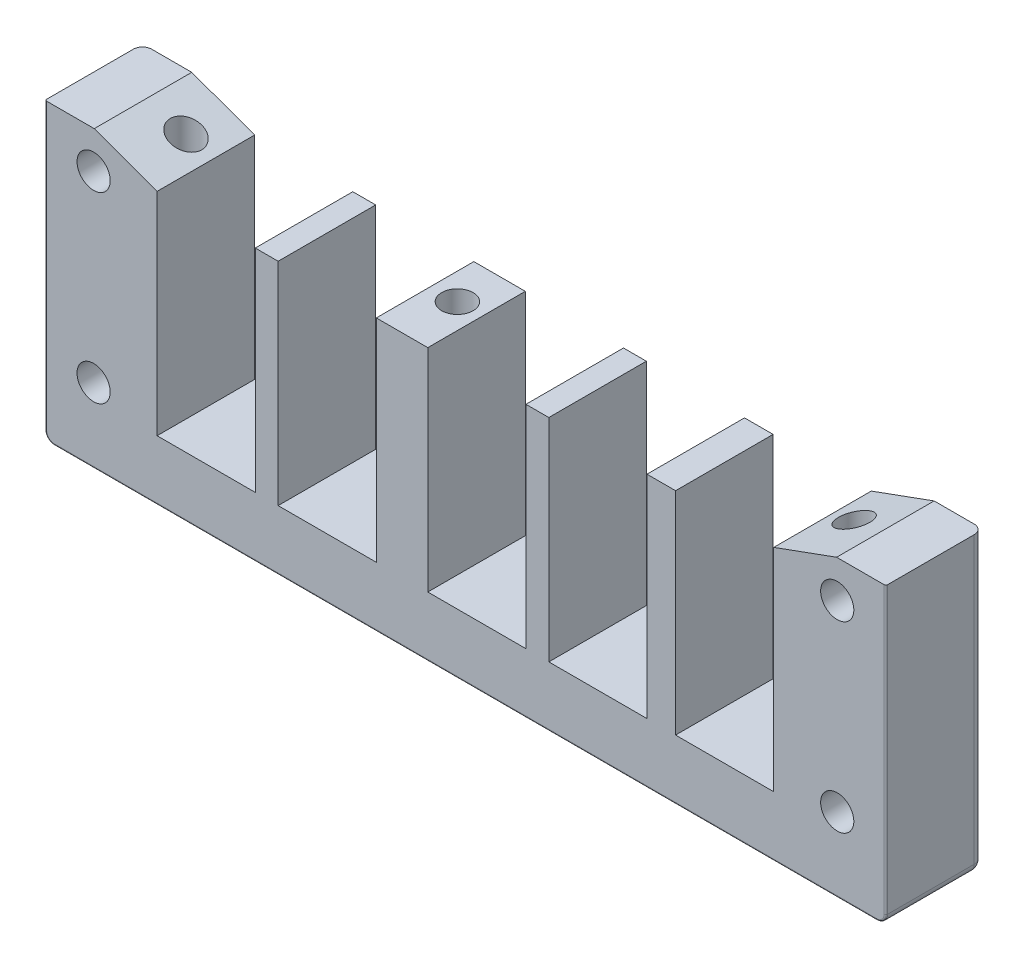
ISO-10303-21;
HEADER;
FILE_DESCRIPTION(('STEP AP214'),'2;1');
FILE_NAME('part.step','',(''),(''),'','','');
FILE_SCHEMA(('AUTOMOTIVE_DESIGN { 1 0 10303 214 1 1 1 1 }'));
ENDSEC;
DATA;
#1=APPLICATION_CONTEXT('core data for automotive mechanical design processes');
#2=APPLICATION_PROTOCOL_DEFINITION('international standard','automotive_design',2000,#1);
#3=PRODUCT_CONTEXT('',#1,'mechanical');
#4=PRODUCT('Part','Part','',(#3));
#5=PRODUCT_RELATED_PRODUCT_CATEGORY('part','',(#4));
#6=PRODUCT_DEFINITION_FORMATION('','',#4);
#7=PRODUCT_DEFINITION_CONTEXT('part definition',#1,'design');
#8=PRODUCT_DEFINITION('design','',#6,#7);
#9=PRODUCT_DEFINITION_SHAPE('','',#8);
#10=(LENGTH_UNIT() NAMED_UNIT(*) SI_UNIT(.MILLI.,.METRE.));
#11=(NAMED_UNIT(*) PLANE_ANGLE_UNIT() SI_UNIT($,.RADIAN.));
#12=(NAMED_UNIT(*) SI_UNIT($,.STERADIAN.) SOLID_ANGLE_UNIT());
#13=UNCERTAINTY_MEASURE_WITH_UNIT(LENGTH_MEASURE(1.E-05),#10,'distance_accuracy_value','');
#14=(GEOMETRIC_REPRESENTATION_CONTEXT(3) GLOBAL_UNCERTAINTY_ASSIGNED_CONTEXT((#13)) GLOBAL_UNIT_ASSIGNED_CONTEXT((#10,
#11,#12)) REPRESENTATION_CONTEXT('',''));
#15=CARTESIAN_POINT('',(0.,0.,0.));
#16=DIRECTION('',(0.,0.,1.));
#17=DIRECTION('',(1.,0.,0.));
#18=AXIS2_PLACEMENT_3D('',#15,#16,#17);
#19=CARTESIAN_POINT('',(60.7671361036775,-22.,3.4));
#20=DIRECTION('',(0.86602540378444,0.,-0.5));
#21=DIRECTION('',(0.,-1.,0.));
#22=AXIS2_PLACEMENT_3D('',#19,#20,#21);
#23=PLANE('',#22);
#24=DIRECTION('',(0.5,0.,0.86602540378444));
#25=VECTOR('',#24,1.);
#26=CARTESIAN_POINT('',(60.7671361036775,-29.,3.4));
#27=LINE('',#26,#25);
#28=CARTESIAN_POINT('',(60.7671361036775,-29.,3.4));
#29=VERTEX_POINT('',#28);
#30=CARTESIAN_POINT('',(63.1342722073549,-29.,7.5));
#31=VERTEX_POINT('',#30);
#32=EDGE_CURVE('E911',#29,#31,#27,.T.);
#33=ORIENTED_EDGE('',*,*,#32,.T.);
#34=DIRECTION('',(0.,-1.,0.));
#35=VECTOR('',#34,1.);
#36=CARTESIAN_POINT('',(63.1342722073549,-22.,7.5));
#37=LINE('',#36,#35);
#38=CARTESIAN_POINT('',(63.1342722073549,-22.,7.5));
#39=VERTEX_POINT('',#38);
#40=EDGE_CURVE('E11',#39,#31,#37,.T.);
#41=ORIENTED_EDGE('',*,*,#40,.F.);
#42=DIRECTION('',(0.5,0.,0.86602540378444));
#43=VECTOR('',#42,1.);
#44=CARTESIAN_POINT('',(60.7671361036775,-22.,3.4));
#45=LINE('',#44,#43);
#46=CARTESIAN_POINT('',(60.7671361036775,-22.,3.4));
#47=VERTEX_POINT('',#46);
#48=EDGE_CURVE('E443',#47,#39,#45,.T.);
#49=ORIENTED_EDGE('',*,*,#48,.F.);
#50=DIRECTION('',(0.,-1.,0.));
#51=VECTOR('',#50,1.);
#52=CARTESIAN_POINT('',(60.7671361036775,-22.,3.4));
#53=LINE('',#52,#51);
#54=EDGE_CURVE('E463',#47,#29,#53,.T.);
#55=ORIENTED_EDGE('',*,*,#54,.T.);
#56=EDGE_LOOP('',(#33,#41,#49,#55));
#57=FACE_BOUND('',#56,.T.);
#58=ADVANCED_FACE('F16',(#57),#23,.F.);
#59=CARTESIAN_POINT('',(63.1342722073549,-22.,7.5));
#60=DIRECTION('',(0.86602540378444,0.,0.5));
#61=DIRECTION('',(0.,-1.,0.));
#62=AXIS2_PLACEMENT_3D('',#59,#60,#61);
#63=PLANE('',#62);
#64=DIRECTION('',(-0.5,0.,0.86602540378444));
#65=VECTOR('',#64,1.);
#66=CARTESIAN_POINT('',(63.1342722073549,-29.,7.5));
#67=LINE('',#66,#65);
#68=CARTESIAN_POINT('',(60.7671361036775,-29.,11.6));
#69=VERTEX_POINT('',#68);
#70=EDGE_CURVE('E497',#31,#69,#67,.T.);
#71=ORIENTED_EDGE('',*,*,#70,.T.);
#72=DIRECTION('',(0.,-1.,0.));
#73=VECTOR('',#72,1.);
#74=CARTESIAN_POINT('',(60.7671361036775,-22.,11.6));
#75=LINE('',#74,#73);
#76=CARTESIAN_POINT('',(60.7671361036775,-22.,11.6));
#77=VERTEX_POINT('',#76);
#78=EDGE_CURVE('E19',#77,#69,#75,.T.);
#79=ORIENTED_EDGE('',*,*,#78,.F.);
#80=DIRECTION('',(-0.5,0.,0.86602540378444));
#81=VECTOR('',#80,1.);
#82=CARTESIAN_POINT('',(63.1342722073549,-22.,7.5));
#83=LINE('',#82,#81);
#84=EDGE_CURVE('E447',#39,#77,#83,.T.);
#85=ORIENTED_EDGE('',*,*,#84,.F.);
#86=ORIENTED_EDGE('',*,*,#40,.T.);
#87=EDGE_LOOP('',(#71,#79,#85,#86));
#88=FACE_BOUND('',#87,.T.);
#89=ADVANCED_FACE('F498',(#88),#63,.F.);
#90=CARTESIAN_POINT('',(60.7671361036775,-22.,11.6));
#91=DIRECTION('',(0.,0.,1.));
#92=DIRECTION('',(1.,0.,0.));
#93=AXIS2_PLACEMENT_3D('',#90,#91,#92);
#94=PLANE('',#93);
#95=DIRECTION('',(-1.,0.,0.));
#96=VECTOR('',#95,1.);
#97=CARTESIAN_POINT('',(60.7671361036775,-29.,11.6));
#98=LINE('',#97,#96);
#99=CARTESIAN_POINT('',(56.0328638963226,-29.,11.6));
#100=VERTEX_POINT('',#99);
#101=EDGE_CURVE('E489',#69,#100,#98,.T.);
#102=ORIENTED_EDGE('',*,*,#101,.T.);
#103=DIRECTION('',(0.,-1.,0.));
#104=VECTOR('',#103,1.);
#105=CARTESIAN_POINT('',(56.0328638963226,-22.,11.6));
#106=LINE('',#105,#104);
#107=CARTESIAN_POINT('',(56.0328638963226,-22.,11.6));
#108=VERTEX_POINT('',#107);
#109=EDGE_CURVE('E472',#108,#100,#106,.T.);
#110=ORIENTED_EDGE('',*,*,#109,.F.);
#111=DIRECTION('',(-1.,0.,0.));
#112=VECTOR('',#111,1.);
#113=CARTESIAN_POINT('',(60.7671361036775,-22.,11.6));
#114=LINE('',#113,#112);
#115=EDGE_CURVE('E451',#77,#108,#114,.T.);
#116=ORIENTED_EDGE('',*,*,#115,.F.);
#117=ORIENTED_EDGE('',*,*,#78,.T.);
#118=EDGE_LOOP('',(#102,#110,#116,#117));
#119=FACE_BOUND('',#118,.T.);
#120=ADVANCED_FACE('F487',(#119),#94,.F.);
#121=CARTESIAN_POINT('',(56.0328638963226,-22.,11.6));
#122=DIRECTION('',(-0.866025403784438,0.,0.5));
#123=DIRECTION('',(0.,1.,0.));
#124=AXIS2_PLACEMENT_3D('',#121,#122,#123);
#125=PLANE('',#124);
#126=DIRECTION('',(-0.5,0.,-0.866025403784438));
#127=VECTOR('',#126,1.);
#128=CARTESIAN_POINT('',(56.0328638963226,-29.,11.6));
#129=LINE('',#128,#127);
#130=CARTESIAN_POINT('',(53.6657277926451,-29.,7.5));
#131=VERTEX_POINT('',#130);
#132=EDGE_CURVE('E510',#100,#131,#129,.T.);
#133=ORIENTED_EDGE('',*,*,#132,.T.);
#134=DIRECTION('',(0.,-1.,0.));
#135=VECTOR('',#134,1.);
#136=CARTESIAN_POINT('',(53.6657277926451,-22.,7.5));
#137=LINE('',#136,#135);
#138=CARTESIAN_POINT('',(53.6657277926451,-22.,7.5));
#139=VERTEX_POINT('',#138);
#140=EDGE_CURVE('E39',#139,#131,#137,.T.);
#141=ORIENTED_EDGE('',*,*,#140,.F.);
#142=DIRECTION('',(-0.5,0.,-0.866025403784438));
#143=VECTOR('',#142,1.);
#144=CARTESIAN_POINT('',(56.0328638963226,-22.,11.6));
#145=LINE('',#144,#143);
#146=EDGE_CURVE('E455',#108,#139,#145,.T.);
#147=ORIENTED_EDGE('',*,*,#146,.F.);
#148=ORIENTED_EDGE('',*,*,#109,.T.);
#149=EDGE_LOOP('',(#133,#141,#147,#148));
#150=FACE_BOUND('',#149,.T.);
#151=ADVANCED_FACE('F1361',(#150),#125,.F.);
#152=CARTESIAN_POINT('',(53.6657277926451,-22.,7.5));
#153=DIRECTION('',(-0.866025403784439,0.,-0.5));
#154=DIRECTION('',(-0.5,0.,0.866025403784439));
#155=AXIS2_PLACEMENT_3D('',#152,#153,#154);
#156=PLANE('',#155);
#157=DIRECTION('',(0.5,0.,-0.866025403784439));
#158=VECTOR('',#157,1.);
#159=CARTESIAN_POINT('',(53.6657277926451,-29.,7.5));
#160=LINE('',#159,#158);
#161=CARTESIAN_POINT('',(56.0328638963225,-29.,3.4));
#162=VERTEX_POINT('',#161);
#163=EDGE_CURVE('E517',#131,#162,#160,.T.);
#164=ORIENTED_EDGE('',*,*,#163,.T.);
#165=DIRECTION('',(0.,-1.,0.));
#166=VECTOR('',#165,1.);
#167=CARTESIAN_POINT('',(56.0328638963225,-22.,3.4));
#168=LINE('',#167,#166);
#169=CARTESIAN_POINT('',(56.0328638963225,-22.,3.4));
#170=VERTEX_POINT('',#169);
#171=EDGE_CURVE('E467',#170,#162,#168,.T.);
#172=ORIENTED_EDGE('',*,*,#171,.F.);
#173=DIRECTION('',(0.5,0.,-0.866025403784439));
#174=VECTOR('',#173,1.);
#175=CARTESIAN_POINT('',(53.6657277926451,-22.,7.5));
#176=LINE('',#175,#174);
#177=EDGE_CURVE('E459',#139,#170,#176,.T.);
#178=ORIENTED_EDGE('',*,*,#177,.F.);
#179=ORIENTED_EDGE('',*,*,#140,.T.);
#180=EDGE_LOOP('',(#164,#172,#178,#179));
#181=FACE_BOUND('',#180,.T.);
#182=ADVANCED_FACE('F1358',(#181),#156,.F.);
#183=CARTESIAN_POINT('',(56.0328638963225,-22.,3.4));
#184=DIRECTION('',(0.,0.,-1.));
#185=DIRECTION('',(-1.,0.,0.));
#186=AXIS2_PLACEMENT_3D('',#183,#184,#185);
#187=PLANE('',#186);
#188=DIRECTION('',(1.,0.,0.));
#189=VECTOR('',#188,1.);
#190=CARTESIAN_POINT('',(56.0328638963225,-29.,3.4));
#191=LINE('',#190,#189);
#192=EDGE_CURVE('E917',#162,#29,#191,.T.);
#193=ORIENTED_EDGE('',*,*,#192,.T.);
#194=ORIENTED_EDGE('',*,*,#54,.F.);
#195=DIRECTION('',(1.,0.,0.));
#196=VECTOR('',#195,1.);
#197=CARTESIAN_POINT('',(56.0328638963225,-22.,3.4));
#198=LINE('',#197,#196);
#199=EDGE_CURVE('E439',#170,#47,#198,.T.);
#200=ORIENTED_EDGE('',*,*,#199,.F.);
#201=ORIENTED_EDGE('',*,*,#171,.T.);
#202=EDGE_LOOP('',(#193,#194,#200,#201));
#203=FACE_BOUND('',#202,.T.);
#204=ADVANCED_FACE('F1355',(#203),#187,.F.);
#205=CARTESIAN_POINT('',(0.,-22.,0.));
#206=DIRECTION('',(0.,-1.,0.));
#207=DIRECTION('',(0.,0.,-1.));
#208=AXIS2_PLACEMENT_3D('',#205,#206,#207);
#209=PLANE('',#208);
#210=CARTESIAN_POINT('',(58.4,-22.,7.5));
#211=DIRECTION('',(0.,1.,0.));
#212=DIRECTION('',(0.,0.,-1.));
#213=AXIS2_PLACEMENT_3D('',#210,#211,#212);
#214=CIRCLE('',#213,2.75);
#215=CARTESIAN_POINT('',(58.4,-22.,4.75));
#216=VERTEX_POINT('',#215);
#217=EDGE_CURVE('E1218',#216,#216,#214,.T.);
#218=ORIENTED_EDGE('',*,*,#217,.T.);
#219=EDGE_LOOP('',(#218));
#220=FACE_BOUND('',#219,.T.);
#221=ORIENTED_EDGE('',*,*,#199,.T.);
#222=ORIENTED_EDGE('',*,*,#48,.T.);
#223=ORIENTED_EDGE('',*,*,#84,.T.);
#224=ORIENTED_EDGE('',*,*,#115,.T.);
#225=ORIENTED_EDGE('',*,*,#146,.T.);
#226=ORIENTED_EDGE('',*,*,#177,.T.);
#227=EDGE_LOOP('',(#221,#222,#223,#224,#225,#226));
#228=FACE_BOUND('',#227,.T.);
#229=ADVANCED_FACE('F1371',(#220,#228),#209,.T.);
#230=CARTESIAN_POINT('',(-8.58286389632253,-22.,3.4));
#231=DIRECTION('',(0.866025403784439,0.,-0.5));
#232=DIRECTION('',(0.,-1.,0.));
#233=AXIS2_PLACEMENT_3D('',#230,#231,#232);
#234=PLANE('',#233);
#235=DIRECTION('',(0.5,0.,0.866025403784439));
#236=VECTOR('',#235,1.);
#237=CARTESIAN_POINT('',(-8.58286389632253,-29.,3.4));
#238=LINE('',#237,#236);
#239=CARTESIAN_POINT('',(-8.58286389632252,-29.,3.4));
#240=VERTEX_POINT('',#239);
#241=CARTESIAN_POINT('',(-6.21572779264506,-29.,7.5));
#242=VERTEX_POINT('',#241);
#243=EDGE_CURVE('E505',#240,#242,#238,.T.);
#244=ORIENTED_EDGE('',*,*,#243,.T.);
#245=DIRECTION('',(0.,-1.,0.));
#246=VECTOR('',#245,1.);
#247=CARTESIAN_POINT('',(-6.21572779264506,-22.,7.5));
#248=LINE('',#247,#246);
#249=CARTESIAN_POINT('',(-6.21572779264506,-22.,7.5));
#250=VERTEX_POINT('',#249);
#251=EDGE_CURVE('E435',#250,#242,#248,.T.);
#252=ORIENTED_EDGE('',*,*,#251,.F.);
#253=DIRECTION('',(0.5,0.,0.866025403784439));
#254=VECTOR('',#253,1.);
#255=CARTESIAN_POINT('',(-8.58286389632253,-22.,3.4));
#256=LINE('',#255,#254);
#257=CARTESIAN_POINT('',(-8.58286389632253,-22.,3.4));
#258=VERTEX_POINT('',#257);
#259=EDGE_CURVE('E399',#258,#250,#256,.T.);
#260=ORIENTED_EDGE('',*,*,#259,.F.);
#261=DIRECTION('',(0.,-1.,0.));
#262=VECTOR('',#261,1.);
#263=CARTESIAN_POINT('',(-8.58286389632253,-22.,3.4));
#264=LINE('',#263,#262);
#265=EDGE_CURVE('E419',#258,#240,#264,.T.);
#266=ORIENTED_EDGE('',*,*,#265,.T.);
#267=EDGE_LOOP('',(#244,#252,#260,#266));
#268=FACE_BOUND('',#267,.T.);
#269=ADVANCED_FACE('F1374',(#268),#234,.F.);
#270=CARTESIAN_POINT('',(-6.21572779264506,-22.,7.5));
#271=DIRECTION('',(0.866025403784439,0.,0.5));
#272=DIRECTION('',(0.,-1.,0.));
#273=AXIS2_PLACEMENT_3D('',#270,#271,#272);
#274=PLANE('',#273);
#275=DIRECTION('',(-0.5,0.,0.866025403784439));
#276=VECTOR('',#275,1.);
#277=CARTESIAN_POINT('',(-6.21572779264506,-29.,7.5));
#278=LINE('',#277,#276);
#279=CARTESIAN_POINT('',(-8.58286389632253,-29.,11.6));
#280=VERTEX_POINT('',#279);
#281=EDGE_CURVE('E567',#242,#280,#278,.T.);
#282=ORIENTED_EDGE('',*,*,#281,.T.);
#283=DIRECTION('',(0.,-1.,0.));
#284=VECTOR('',#283,1.);
#285=CARTESIAN_POINT('',(-8.58286389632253,-22.,11.6));
#286=LINE('',#285,#284);
#287=CARTESIAN_POINT('',(-8.58286389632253,-22.,11.6));
#288=VERTEX_POINT('',#287);
#289=EDGE_CURVE('E431',#288,#280,#286,.T.);
#290=ORIENTED_EDGE('',*,*,#289,.F.);
#291=DIRECTION('',(-0.5,0.,0.866025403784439));
#292=VECTOR('',#291,1.);
#293=CARTESIAN_POINT('',(-6.21572779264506,-22.,7.5));
#294=LINE('',#293,#292);
#295=EDGE_CURVE('E403',#250,#288,#294,.T.);
#296=ORIENTED_EDGE('',*,*,#295,.F.);
#297=ORIENTED_EDGE('',*,*,#251,.T.);
#298=EDGE_LOOP('',(#282,#290,#296,#297));
#299=FACE_BOUND('',#298,.T.);
#300=ADVANCED_FACE('F1378',(#299),#274,.F.);
#301=CARTESIAN_POINT('',(-8.58286389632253,-22.,11.6));
#302=DIRECTION('',(0.,0.,1.));
#303=DIRECTION('',(1.,0.,0.));
#304=AXIS2_PLACEMENT_3D('',#301,#302,#303);
#305=PLANE('',#304);
#306=DIRECTION('',(-1.,0.,0.));
#307=VECTOR('',#306,1.);
#308=CARTESIAN_POINT('',(-8.58286389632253,-29.,11.6));
#309=LINE('',#308,#307);
#310=CARTESIAN_POINT('',(-13.3171361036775,-29.,11.6));
#311=VERTEX_POINT('',#310);
#312=EDGE_CURVE('E560',#280,#311,#309,.T.);
#313=ORIENTED_EDGE('',*,*,#312,.T.);
#314=DIRECTION('',(0.,-1.,0.));
#315=VECTOR('',#314,1.);
#316=CARTESIAN_POINT('',(-13.3171361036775,-22.,11.6));
#317=LINE('',#316,#315);
#318=CARTESIAN_POINT('',(-13.3171361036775,-22.,11.6));
#319=VERTEX_POINT('',#318);
#320=EDGE_CURVE('E167',#319,#311,#317,.T.);
#321=ORIENTED_EDGE('',*,*,#320,.F.);
#322=DIRECTION('',(-1.,0.,0.));
#323=VECTOR('',#322,1.);
#324=CARTESIAN_POINT('',(-8.58286389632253,-22.,11.6));
#325=LINE('',#324,#323);
#326=EDGE_CURVE('E407',#288,#319,#325,.T.);
#327=ORIENTED_EDGE('',*,*,#326,.F.);
#328=ORIENTED_EDGE('',*,*,#289,.T.);
#329=EDGE_LOOP('',(#313,#321,#327,#328));
#330=FACE_BOUND('',#329,.T.);
#331=ADVANCED_FACE('F1382',(#330),#305,.F.);
#332=CARTESIAN_POINT('',(-13.3171361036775,-22.,11.6));
#333=DIRECTION('',(-0.866025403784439,0.,0.5));
#334=DIRECTION('',(0.,1.,0.));
#335=AXIS2_PLACEMENT_3D('',#332,#333,#334);
#336=PLANE('',#335);
#337=DIRECTION('',(-0.5,0.,-0.866025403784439));
#338=VECTOR('',#337,1.);
#339=CARTESIAN_POINT('',(-13.3171361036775,-29.,11.6));
#340=LINE('',#339,#338);
#341=CARTESIAN_POINT('',(-15.6842722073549,-29.,7.5));
#342=VERTEX_POINT('',#341);
#343=EDGE_CURVE('E551',#311,#342,#340,.T.);
#344=ORIENTED_EDGE('',*,*,#343,.T.);
#345=DIRECTION('',(0.,-1.,0.));
#346=VECTOR('',#345,1.);
#347=CARTESIAN_POINT('',(-15.6842722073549,-22.,7.5));
#348=LINE('',#347,#346);
#349=CARTESIAN_POINT('',(-15.6842722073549,-22.,7.5));
#350=VERTEX_POINT('',#349);
#351=EDGE_CURVE('E151',#350,#342,#348,.T.);
#352=ORIENTED_EDGE('',*,*,#351,.F.);
#353=DIRECTION('',(-0.5,0.,-0.866025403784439));
#354=VECTOR('',#353,1.);
#355=CARTESIAN_POINT('',(-13.3171361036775,-22.,11.6));
#356=LINE('',#355,#354);
#357=EDGE_CURVE('E411',#319,#350,#356,.T.);
#358=ORIENTED_EDGE('',*,*,#357,.F.);
#359=ORIENTED_EDGE('',*,*,#320,.T.);
#360=EDGE_LOOP('',(#344,#352,#358,#359));
#361=FACE_BOUND('',#360,.T.);
#362=ADVANCED_FACE('F1386',(#361),#336,.F.);
#363=CARTESIAN_POINT('',(-15.6842722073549,-22.,7.5));
#364=DIRECTION('',(-0.866025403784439,0.,-0.5));
#365=DIRECTION('',(-0.5,0.,0.866025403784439));
#366=AXIS2_PLACEMENT_3D('',#363,#364,#365);
#367=PLANE('',#366);
#368=DIRECTION('',(0.5,0.,-0.866025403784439));
#369=VECTOR('',#368,1.);
#370=CARTESIAN_POINT('',(-15.6842722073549,-29.,7.5));
#371=LINE('',#370,#369);
#372=CARTESIAN_POINT('',(-13.3171361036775,-29.,3.4));
#373=VERTEX_POINT('',#372);
#374=EDGE_CURVE('E543',#342,#373,#371,.T.);
#375=ORIENTED_EDGE('',*,*,#374,.T.);
#376=DIRECTION('',(0.,-1.,0.));
#377=VECTOR('',#376,1.);
#378=CARTESIAN_POINT('',(-13.3171361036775,-22.,3.4));
#379=LINE('',#378,#377);
#380=CARTESIAN_POINT('',(-13.3171361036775,-22.,3.4));
#381=VERTEX_POINT('',#380);
#382=EDGE_CURVE('E423',#381,#373,#379,.T.);
#383=ORIENTED_EDGE('',*,*,#382,.F.);
#384=DIRECTION('',(0.5,0.,-0.866025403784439));
#385=VECTOR('',#384,1.);
#386=CARTESIAN_POINT('',(-15.6842722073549,-22.,7.5));
#387=LINE('',#386,#385);
#388=EDGE_CURVE('E415',#350,#381,#387,.T.);
#389=ORIENTED_EDGE('',*,*,#388,.F.);
#390=ORIENTED_EDGE('',*,*,#351,.T.);
#391=EDGE_LOOP('',(#375,#383,#389,#390));
#392=FACE_BOUND('',#391,.T.);
#393=ADVANCED_FACE('F1387',(#392),#367,.F.);
#394=CARTESIAN_POINT('',(-13.3171361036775,-22.,3.4));
#395=DIRECTION('',(0.,0.,-1.));
#396=DIRECTION('',(0.,-1.,0.));
#397=AXIS2_PLACEMENT_3D('',#394,#395,#396);
#398=PLANE('',#397);
#399=DIRECTION('',(1.,0.,0.));
#400=VECTOR('',#399,1.);
#401=CARTESIAN_POINT('',(-13.3171361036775,-29.,3.4));
#402=LINE('',#401,#400);
#403=EDGE_CURVE('E533',#373,#240,#402,.T.);
#404=ORIENTED_EDGE('',*,*,#403,.T.);
#405=ORIENTED_EDGE('',*,*,#265,.F.);
#406=DIRECTION('',(1.,0.,0.));
#407=VECTOR('',#406,1.);
#408=CARTESIAN_POINT('',(-13.3171361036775,-22.,3.4));
#409=LINE('',#408,#407);
#410=EDGE_CURVE('E395',#381,#258,#409,.T.);
#411=ORIENTED_EDGE('',*,*,#410,.F.);
#412=ORIENTED_EDGE('',*,*,#382,.T.);
#413=EDGE_LOOP('',(#404,#405,#411,#412));
#414=FACE_BOUND('',#413,.T.);
#415=ADVANCED_FACE('F1390',(#414),#398,.F.);
#416=CARTESIAN_POINT('',(0.,-22.,0.));
#417=DIRECTION('',(0.,-1.,0.));
#418=DIRECTION('',(0.,0.,-1.));
#419=AXIS2_PLACEMENT_3D('',#416,#417,#418);
#420=PLANE('',#419);
#421=CARTESIAN_POINT('',(-10.95,-22.,7.5));
#422=DIRECTION('',(0.,1.,0.));
#423=DIRECTION('',(1.,0.,0.));
#424=AXIS2_PLACEMENT_3D('',#421,#422,#423);
#425=CIRCLE('',#424,2.75);
#426=CARTESIAN_POINT('',(-8.2,-22.,7.5));
#427=VERTEX_POINT('',#426);
#428=EDGE_CURVE('E866',#427,#427,#425,.T.);
#429=ORIENTED_EDGE('',*,*,#428,.T.);
#430=EDGE_LOOP('',(#429));
#431=FACE_BOUND('',#430,.T.);
#432=ORIENTED_EDGE('',*,*,#410,.T.);
#433=ORIENTED_EDGE('',*,*,#259,.T.);
#434=ORIENTED_EDGE('',*,*,#295,.T.);
#435=ORIENTED_EDGE('',*,*,#326,.T.);
#436=ORIENTED_EDGE('',*,*,#357,.T.);
#437=ORIENTED_EDGE('',*,*,#388,.T.);
#438=EDGE_LOOP('',(#432,#433,#434,#435,#436,#437));
#439=FACE_BOUND('',#438,.T.);
#440=ADVANCED_FACE('F1392',(#431,#439),#420,.T.);
#441=CARTESIAN_POINT('',(-56.0328638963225,-22.,3.4));
#442=DIRECTION('',(0.866025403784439,0.,-0.5));
#443=DIRECTION('',(0.,-1.,0.));
#444=AXIS2_PLACEMENT_3D('',#441,#442,#443);
#445=PLANE('',#444);
#446=DIRECTION('',(0.5,0.,0.866025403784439));
#447=VECTOR('',#446,1.);
#448=CARTESIAN_POINT('',(-56.0328638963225,-29.,3.4));
#449=LINE('',#448,#447);
#450=CARTESIAN_POINT('',(-56.0328638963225,-29.,3.4));
#451=VERTEX_POINT('',#450);
#452=CARTESIAN_POINT('',(-53.6657277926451,-29.,7.5));
#453=VERTEX_POINT('',#452);
#454=EDGE_CURVE('E571',#451,#453,#449,.T.);
#455=ORIENTED_EDGE('',*,*,#454,.T.);
#456=DIRECTION('',(0.,-1.,0.));
#457=VECTOR('',#456,1.);
#458=CARTESIAN_POINT('',(-53.6657277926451,-22.,7.5));
#459=LINE('',#458,#457);
#460=CARTESIAN_POINT('',(-53.6657277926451,-22.,7.5));
#461=VERTEX_POINT('',#460);
#462=EDGE_CURVE('E391',#461,#453,#459,.T.);
#463=ORIENTED_EDGE('',*,*,#462,.F.);
#464=DIRECTION('',(0.5,0.,0.866025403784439));
#465=VECTOR('',#464,1.);
#466=CARTESIAN_POINT('',(-56.0328638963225,-22.,3.4));
#467=LINE('',#466,#465);
#468=CARTESIAN_POINT('',(-56.0328638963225,-22.,3.4));
#469=VERTEX_POINT('',#468);
#470=EDGE_CURVE('E365',#469,#461,#467,.T.);
#471=ORIENTED_EDGE('',*,*,#470,.F.);
#472=DIRECTION('',(0.,-1.,0.));
#473=VECTOR('',#472,1.);
#474=CARTESIAN_POINT('',(-56.0328638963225,-22.,3.4));
#475=LINE('',#474,#473);
#476=EDGE_CURVE('E370',#469,#451,#475,.T.);
#477=ORIENTED_EDGE('',*,*,#476,.T.);
#478=EDGE_LOOP('',(#455,#463,#471,#477));
#479=FACE_BOUND('',#478,.T.);
#480=ADVANCED_FACE('F1395',(#479),#445,.F.);
#481=CARTESIAN_POINT('',(-53.6657277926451,-22.,7.5));
#482=DIRECTION('',(0.866025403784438,0.,0.5));
#483=DIRECTION('',(0.,-1.,0.));
#484=AXIS2_PLACEMENT_3D('',#481,#482,#483);
#485=PLANE('',#484);
#486=DIRECTION('',(-0.5,0.,0.866025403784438));
#487=VECTOR('',#486,1.);
#488=CARTESIAN_POINT('',(-53.6657277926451,-29.,7.5));
#489=LINE('',#488,#487);
#490=CARTESIAN_POINT('',(-56.0328638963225,-29.,11.6));
#491=VERTEX_POINT('',#490);
#492=EDGE_CURVE('E616',#453,#491,#489,.T.);
#493=ORIENTED_EDGE('',*,*,#492,.T.);
#494=DIRECTION('',(0.,-1.,0.));
#495=VECTOR('',#494,1.);
#496=CARTESIAN_POINT('',(-56.0328638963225,-22.,11.6));
#497=LINE('',#496,#495);
#498=CARTESIAN_POINT('',(-56.0328638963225,-22.,11.6));
#499=VERTEX_POINT('',#498);
#500=EDGE_CURVE('E387',#499,#491,#497,.T.);
#501=ORIENTED_EDGE('',*,*,#500,.F.);
#502=DIRECTION('',(-0.5,0.,0.866025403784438));
#503=VECTOR('',#502,1.);
#504=CARTESIAN_POINT('',(-53.6657277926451,-22.,7.5));
#505=LINE('',#504,#503);
#506=EDGE_CURVE('E369',#461,#499,#505,.T.);
#507=ORIENTED_EDGE('',*,*,#506,.F.);
#508=ORIENTED_EDGE('',*,*,#462,.T.);
#509=EDGE_LOOP('',(#493,#501,#507,#508));
#510=FACE_BOUND('',#509,.T.);
#511=ADVANCED_FACE('F1399',(#510),#485,.F.);
#512=CARTESIAN_POINT('',(-56.0328638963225,-22.,11.6));
#513=DIRECTION('',(0.,0.,1.));
#514=DIRECTION('',(1.,0.,0.));
#515=AXIS2_PLACEMENT_3D('',#512,#513,#514);
#516=PLANE('',#515);
#517=DIRECTION('',(-1.,0.,0.));
#518=VECTOR('',#517,1.);
#519=CARTESIAN_POINT('',(-56.0328638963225,-29.,11.6));
#520=LINE('',#519,#518);
#521=CARTESIAN_POINT('',(-60.7671361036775,-29.,11.6));
#522=VERTEX_POINT('',#521);
#523=EDGE_CURVE('E608',#491,#522,#520,.T.);
#524=ORIENTED_EDGE('',*,*,#523,.T.);
#525=DIRECTION('',(0.,-1.,0.));
#526=VECTOR('',#525,1.);
#527=CARTESIAN_POINT('',(-60.7671361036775,-22.,11.6));
#528=LINE('',#527,#526);
#529=CARTESIAN_POINT('',(-60.7671361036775,-22.,11.6));
#530=VERTEX_POINT('',#529);
#531=EDGE_CURVE('E383',#530,#522,#528,.T.);
#532=ORIENTED_EDGE('',*,*,#531,.F.);
#533=DIRECTION('',(-1.,0.,0.));
#534=VECTOR('',#533,1.);
#535=CARTESIAN_POINT('',(-56.0328638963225,-22.,11.6));
#536=LINE('',#535,#534);
#537=EDGE_CURVE('E927',#499,#530,#536,.T.);
#538=ORIENTED_EDGE('',*,*,#537,.F.);
#539=ORIENTED_EDGE('',*,*,#500,.T.);
#540=EDGE_LOOP('',(#524,#532,#538,#539));
#541=FACE_BOUND('',#540,.T.);
#542=ADVANCED_FACE('F1403',(#541),#516,.F.);
#543=CARTESIAN_POINT('',(-60.7671361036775,-22.,11.6));
#544=DIRECTION('',(-0.866025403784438,0.,0.5));
#545=DIRECTION('',(0.,1.,0.));
#546=AXIS2_PLACEMENT_3D('',#543,#544,#545);
#547=PLANE('',#546);
#548=DIRECTION('',(-0.5,0.,-0.866025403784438));
#549=VECTOR('',#548,1.);
#550=CARTESIAN_POINT('',(-60.7671361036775,-29.,11.6));
#551=LINE('',#550,#549);
#552=CARTESIAN_POINT('',(-63.1342722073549,-29.,7.5));
#553=VERTEX_POINT('',#552);
#554=EDGE_CURVE('E589',#522,#553,#551,.T.);
#555=ORIENTED_EDGE('',*,*,#554,.T.);
#556=DIRECTION('',(0.,-1.,0.));
#557=VECTOR('',#556,1.);
#558=CARTESIAN_POINT('',(-63.1342722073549,-22.,7.5));
#559=LINE('',#558,#557);
#560=CARTESIAN_POINT('',(-63.1342722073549,-22.,7.5));
#561=VERTEX_POINT('',#560);
#562=EDGE_CURVE('E379',#561,#553,#559,.T.);
#563=ORIENTED_EDGE('',*,*,#562,.F.);
#564=DIRECTION('',(-0.5,0.,-0.866025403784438));
#565=VECTOR('',#564,1.);
#566=CARTESIAN_POINT('',(-60.7671361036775,-22.,11.6));
#567=LINE('',#566,#565);
#568=EDGE_CURVE('E931',#530,#561,#567,.T.);
#569=ORIENTED_EDGE('',*,*,#568,.F.);
#570=ORIENTED_EDGE('',*,*,#531,.T.);
#571=EDGE_LOOP('',(#555,#563,#569,#570));
#572=FACE_BOUND('',#571,.T.);
#573=ADVANCED_FACE('F1407',(#572),#547,.F.);
#574=CARTESIAN_POINT('',(-63.1342722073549,-22.,7.5));
#575=DIRECTION('',(-0.866025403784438,0.,-0.5));
#576=DIRECTION('',(-0.5,0.,0.866025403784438));
#577=AXIS2_PLACEMENT_3D('',#574,#575,#576);
#578=PLANE('',#577);
#579=DIRECTION('',(0.5,0.,-0.866025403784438));
#580=VECTOR('',#579,1.);
#581=CARTESIAN_POINT('',(-63.1342722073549,-29.,7.5));
#582=LINE('',#581,#580);
#583=CARTESIAN_POINT('',(-60.7671361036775,-29.,3.4));
#584=VERTEX_POINT('',#583);
#585=EDGE_CURVE('E579',#553,#584,#582,.T.);
#586=ORIENTED_EDGE('',*,*,#585,.T.);
#587=DIRECTION('',(0.,-1.,0.));
#588=VECTOR('',#587,1.);
#589=CARTESIAN_POINT('',(-60.7671361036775,-22.,3.4));
#590=LINE('',#589,#588);
#591=CARTESIAN_POINT('',(-60.7671361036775,-22.,3.4));
#592=VERTEX_POINT('',#591);
#593=EDGE_CURVE('E374',#592,#584,#590,.T.);
#594=ORIENTED_EDGE('',*,*,#593,.F.);
#595=DIRECTION('',(0.5,0.,-0.866025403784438));
#596=VECTOR('',#595,1.);
#597=CARTESIAN_POINT('',(-63.1342722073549,-22.,7.5));
#598=LINE('',#597,#596);
#599=EDGE_CURVE('E375',#561,#592,#598,.T.);
#600=ORIENTED_EDGE('',*,*,#599,.F.);
#601=ORIENTED_EDGE('',*,*,#562,.T.);
#602=EDGE_LOOP('',(#586,#594,#600,#601));
#603=FACE_BOUND('',#602,.T.);
#604=ADVANCED_FACE('F1472',(#603),#578,.F.);
#605=CARTESIAN_POINT('',(-60.7671361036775,-22.,3.4));
#606=DIRECTION('',(0.,0.,-1.));
#607=DIRECTION('',(0.,-1.,0.));
#608=AXIS2_PLACEMENT_3D('',#605,#606,#607);
#609=PLANE('',#608);
#610=DIRECTION('',(1.,0.,0.));
#611=VECTOR('',#610,1.);
#612=CARTESIAN_POINT('',(-60.7671361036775,-29.,3.4));
#613=LINE('',#612,#611);
#614=EDGE_CURVE('E575',#584,#451,#613,.T.);
#615=ORIENTED_EDGE('',*,*,#614,.T.);
#616=ORIENTED_EDGE('',*,*,#476,.F.);
#617=DIRECTION('',(1.,0.,0.));
#618=VECTOR('',#617,1.);
#619=CARTESIAN_POINT('',(-60.7671361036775,-22.,3.4));
#620=LINE('',#619,#618);
#621=EDGE_CURVE('E361',#592,#469,#620,.T.);
#622=ORIENTED_EDGE('',*,*,#621,.F.);
#623=ORIENTED_EDGE('',*,*,#593,.T.);
#624=EDGE_LOOP('',(#615,#616,#622,#623));
#625=FACE_BOUND('',#624,.T.);
#626=ADVANCED_FACE('F1413',(#625),#609,.F.);
#627=CARTESIAN_POINT('',(0.,-22.,0.));
#628=DIRECTION('',(0.,-1.,0.));
#629=DIRECTION('',(0.,0.,-1.));
#630=AXIS2_PLACEMENT_3D('',#627,#628,#629);
#631=PLANE('',#630);
#632=CARTESIAN_POINT('',(-58.4,-22.,7.5));
#633=DIRECTION('',(0.,1.,0.));
#634=DIRECTION('',(0.,0.,-1.));
#635=AXIS2_PLACEMENT_3D('',#632,#633,#634);
#636=CIRCLE('',#635,2.75);
#637=CARTESIAN_POINT('',(-58.4,-22.,4.75));
#638=VERTEX_POINT('',#637);
#639=EDGE_CURVE('E865',#638,#638,#636,.T.);
#640=ORIENTED_EDGE('',*,*,#639,.T.);
#641=EDGE_LOOP('',(#640));
#642=FACE_BOUND('',#641,.T.);
#643=ORIENTED_EDGE('',*,*,#621,.T.);
#644=ORIENTED_EDGE('',*,*,#470,.T.);
#645=ORIENTED_EDGE('',*,*,#506,.T.);
#646=ORIENTED_EDGE('',*,*,#537,.T.);
#647=ORIENTED_EDGE('',*,*,#568,.T.);
#648=ORIENTED_EDGE('',*,*,#599,.T.);
#649=EDGE_LOOP('',(#643,#644,#645,#646,#647,#648));
#650=FACE_BOUND('',#649,.T.);
#651=ADVANCED_FACE('F1409',(#642,#650),#631,.T.);
#652=CARTESIAN_POINT('',(65.,16.,0.));
#653=DIRECTION('',(0.,0.,-1.));
#654=DIRECTION('',(-1.,0.,0.));
#655=AXIS2_PLACEMENT_3D('',#652,#653,#654);
#656=CYLINDRICAL_SURFACE('',#655,5.);
#657=CARTESIAN_POINT('',(65.,16.,4.9));
#658=DIRECTION('',(0.,0.,-1.));
#659=DIRECTION('',(-1.,0.,0.));
#660=AXIS2_PLACEMENT_3D('',#657,#658,#659);
#661=CIRCLE('',#660,5.);
#662=CARTESIAN_POINT('',(60.,16.,4.9));
#663=VERTEX_POINT('',#662);
#664=EDGE_CURVE('E358',#663,#663,#661,.T.);
#665=ORIENTED_EDGE('',*,*,#664,.F.);
#666=EDGE_LOOP('',(#665));
#667=FACE_BOUND('',#666,.T.);
#668=CARTESIAN_POINT('',(65.,16.,0.));
#669=DIRECTION('',(0.,0.,-1.));
#670=DIRECTION('',(-1.,0.,0.));
#671=AXIS2_PLACEMENT_3D('',#668,#669,#670);
#672=CIRCLE('',#671,5.);
#673=CARTESIAN_POINT('',(60.,16.,0.));
#674=VERTEX_POINT('',#673);
#675=EDGE_CURVE('E268',#674,#674,#672,.T.);
#676=ORIENTED_EDGE('',*,*,#675,.T.);
#677=EDGE_LOOP('',(#676));
#678=FACE_BOUND('',#677,.T.);
#679=ADVANCED_FACE('F1412',(#667,#678),#656,.F.);
#680=CARTESIAN_POINT('',(67.9,16.,4.9));
#681=DIRECTION('',(0.,0.,1.));
#682=DIRECTION('',(1.,0.,0.));
#683=AXIS2_PLACEMENT_3D('',#680,#681,#682);
#684=PLANE('',#683);
#685=CARTESIAN_POINT('',(65.,16.,4.9));
#686=DIRECTION('',(0.,0.,-1.));
#687=DIRECTION('',(-1.,0.,0.));
#688=AXIS2_PLACEMENT_3D('',#685,#686,#687);
#689=CIRCLE('',#688,2.9);
#690=CARTESIAN_POINT('',(62.1,16.,4.9));
#691=VERTEX_POINT('',#690);
#692=EDGE_CURVE('E354',#691,#691,#689,.T.);
#693=ORIENTED_EDGE('',*,*,#692,.F.);
#694=EDGE_LOOP('',(#693));
#695=FACE_BOUND('',#694,.T.);
#696=ORIENTED_EDGE('',*,*,#664,.T.);
#697=EDGE_LOOP('',(#696));
#698=FACE_BOUND('',#697,.T.);
#699=ADVANCED_FACE('F1417',(#695,#698),#684,.F.);
#700=CARTESIAN_POINT('',(65.,16.,0.));
#701=DIRECTION('',(0.,0.,-1.));
#702=DIRECTION('',(-1.,0.,0.));
#703=AXIS2_PLACEMENT_3D('',#700,#701,#702);
#704=CYLINDRICAL_SURFACE('',#703,2.9);
#705=CARTESIAN_POINT('',(65.,16.,17.05));
#706=DIRECTION('',(0.,0.,-1.));
#707=DIRECTION('',(-1.,0.,0.));
#708=AXIS2_PLACEMENT_3D('',#705,#706,#707);
#709=CIRCLE('',#708,2.9);
#710=CARTESIAN_POINT('',(62.1,16.,17.05));
#711=VERTEX_POINT('',#710);
#712=EDGE_CURVE('E305',#711,#711,#709,.T.);
#713=ORIENTED_EDGE('',*,*,#712,.F.);
#714=EDGE_LOOP('',(#713));
#715=FACE_BOUND('',#714,.T.);
#716=ORIENTED_EDGE('',*,*,#692,.T.);
#717=EDGE_LOOP('',(#716));
#718=FACE_BOUND('',#717,.T.);
#719=ADVANCED_FACE('F1419',(#715,#718),#704,.F.);
#720=CARTESIAN_POINT('',(65.,-16.,0.));
#721=DIRECTION('',(0.,0.,-1.));
#722=DIRECTION('',(-1.,0.,0.));
#723=AXIS2_PLACEMENT_3D('',#720,#721,#722);
#724=CYLINDRICAL_SURFACE('',#723,5.);
#725=CARTESIAN_POINT('',(65.,-16.,4.9));
#726=DIRECTION('',(0.,0.,-1.));
#727=DIRECTION('',(-1.,0.,0.));
#728=AXIS2_PLACEMENT_3D('',#725,#726,#727);
#729=CIRCLE('',#728,5.);
#730=CARTESIAN_POINT('',(60.,-16.,4.9));
#731=VERTEX_POINT('',#730);
#732=EDGE_CURVE('E351',#731,#731,#729,.T.);
#733=ORIENTED_EDGE('',*,*,#732,.F.);
#734=EDGE_LOOP('',(#733));
#735=FACE_BOUND('',#734,.T.);
#736=CARTESIAN_POINT('',(65.,-16.,0.));
#737=DIRECTION('',(0.,0.,-1.));
#738=DIRECTION('',(-1.,0.,0.));
#739=AXIS2_PLACEMENT_3D('',#736,#737,#738);
#740=CIRCLE('',#739,5.);
#741=CARTESIAN_POINT('',(60.,-16.,0.));
#742=VERTEX_POINT('',#741);
#743=EDGE_CURVE('E271',#742,#742,#740,.T.);
#744=ORIENTED_EDGE('',*,*,#743,.T.);
#745=EDGE_LOOP('',(#744));
#746=FACE_BOUND('',#745,.T.);
#747=ADVANCED_FACE('F1422',(#735,#746),#724,.F.);
#748=CARTESIAN_POINT('',(67.9,-16.,4.9));
#749=DIRECTION('',(0.,0.,1.));
#750=DIRECTION('',(1.,0.,0.));
#751=AXIS2_PLACEMENT_3D('',#748,#749,#750);
#752=PLANE('',#751);
#753=CARTESIAN_POINT('',(65.,-16.,4.9));
#754=DIRECTION('',(0.,0.,-1.));
#755=DIRECTION('',(-1.,0.,0.));
#756=AXIS2_PLACEMENT_3D('',#753,#754,#755);
#757=CIRCLE('',#756,2.9);
#758=CARTESIAN_POINT('',(62.1,-16.,4.9));
#759=VERTEX_POINT('',#758);
#760=EDGE_CURVE('E348',#759,#759,#757,.T.);
#761=ORIENTED_EDGE('',*,*,#760,.F.);
#762=EDGE_LOOP('',(#761));
#763=FACE_BOUND('',#762,.T.);
#764=ORIENTED_EDGE('',*,*,#732,.T.);
#765=EDGE_LOOP('',(#764));
#766=FACE_BOUND('',#765,.T.);
#767=ADVANCED_FACE('F1426',(#763,#766),#752,.F.);
#768=CARTESIAN_POINT('',(65.,-16.,0.));
#769=DIRECTION('',(0.,0.,-1.));
#770=DIRECTION('',(-1.,0.,0.));
#771=AXIS2_PLACEMENT_3D('',#768,#769,#770);
#772=CYLINDRICAL_SURFACE('',#771,2.9);
#773=CARTESIAN_POINT('',(65.,-16.,17.05));
#774=DIRECTION('',(0.,0.,-1.));
#775=DIRECTION('',(-1.,0.,0.));
#776=AXIS2_PLACEMENT_3D('',#773,#774,#775);
#777=CIRCLE('',#776,2.9);
#778=CARTESIAN_POINT('',(62.1,-16.,17.05));
#779=VERTEX_POINT('',#778);
#780=EDGE_CURVE('E309',#779,#779,#777,.T.);
#781=ORIENTED_EDGE('',*,*,#780,.F.);
#782=EDGE_LOOP('',(#781));
#783=FACE_BOUND('',#782,.T.);
#784=ORIENTED_EDGE('',*,*,#760,.T.);
#785=EDGE_LOOP('',(#784));
#786=FACE_BOUND('',#785,.T.);
#787=ADVANCED_FACE('F1430',(#783,#786),#772,.F.);
#788=CARTESIAN_POINT('',(-65.,-16.,0.));
#789=DIRECTION('',(0.,0.,-1.));
#790=DIRECTION('',(-1.,0.,0.));
#791=AXIS2_PLACEMENT_3D('',#788,#789,#790);
#792=CYLINDRICAL_SURFACE('',#791,5.);
#793=CARTESIAN_POINT('',(-65.,-16.,4.9));
#794=DIRECTION('',(0.,0.,-1.));
#795=DIRECTION('',(-1.,0.,0.));
#796=AXIS2_PLACEMENT_3D('',#793,#794,#795);
#797=CIRCLE('',#796,5.);
#798=CARTESIAN_POINT('',(-70.,-16.,4.9));
#799=VERTEX_POINT('',#798);
#800=EDGE_CURVE('E345',#799,#799,#797,.T.);
#801=ORIENTED_EDGE('',*,*,#800,.F.);
#802=EDGE_LOOP('',(#801));
#803=FACE_BOUND('',#802,.T.);
#804=CARTESIAN_POINT('',(-65.,-16.,0.));
#805=DIRECTION('',(0.,0.,-1.));
#806=DIRECTION('',(-1.,0.,0.));
#807=AXIS2_PLACEMENT_3D('',#804,#805,#806);
#808=CIRCLE('',#807,5.);
#809=CARTESIAN_POINT('',(-70.,-16.,0.));
#810=VERTEX_POINT('',#809);
#811=EDGE_CURVE('E594',#810,#810,#808,.T.);
#812=ORIENTED_EDGE('',*,*,#811,.T.);
#813=EDGE_LOOP('',(#812));
#814=FACE_BOUND('',#813,.T.);
#815=ADVANCED_FACE('F1434',(#803,#814),#792,.F.);
#816=CARTESIAN_POINT('',(-62.1,-16.,4.9));
#817=DIRECTION('',(0.,0.,1.));
#818=DIRECTION('',(1.,0.,0.));
#819=AXIS2_PLACEMENT_3D('',#816,#817,#818);
#820=PLANE('',#819);
#821=CARTESIAN_POINT('',(-65.,-16.,4.9));
#822=DIRECTION('',(0.,0.,-1.));
#823=DIRECTION('',(-1.,0.,0.));
#824=AXIS2_PLACEMENT_3D('',#821,#822,#823);
#825=CIRCLE('',#824,2.9);
#826=CARTESIAN_POINT('',(-67.9,-16.,4.9));
#827=VERTEX_POINT('',#826);
#828=EDGE_CURVE('E342',#827,#827,#825,.T.);
#829=ORIENTED_EDGE('',*,*,#828,.F.);
#830=EDGE_LOOP('',(#829));
#831=FACE_BOUND('',#830,.T.);
#832=ORIENTED_EDGE('',*,*,#800,.T.);
#833=EDGE_LOOP('',(#832));
#834=FACE_BOUND('',#833,.T.);
#835=ADVANCED_FACE('F1438',(#831,#834),#820,.F.);
#836=CARTESIAN_POINT('',(-65.,-16.,0.));
#837=DIRECTION('',(0.,0.,-1.));
#838=DIRECTION('',(-1.,0.,0.));
#839=AXIS2_PLACEMENT_3D('',#836,#837,#838);
#840=CYLINDRICAL_SURFACE('',#839,2.9);
#841=CARTESIAN_POINT('',(-65.,-16.,17.05));
#842=DIRECTION('',(0.,0.,-1.));
#843=DIRECTION('',(-1.,0.,0.));
#844=AXIS2_PLACEMENT_3D('',#841,#842,#843);
#845=CIRCLE('',#844,2.9);
#846=CARTESIAN_POINT('',(-67.9,-16.,17.05));
#847=VERTEX_POINT('',#846);
#848=EDGE_CURVE('E313',#847,#847,#845,.T.);
#849=ORIENTED_EDGE('',*,*,#848,.F.);
#850=EDGE_LOOP('',(#849));
#851=FACE_BOUND('',#850,.T.);
#852=ORIENTED_EDGE('',*,*,#828,.T.);
#853=EDGE_LOOP('',(#852));
#854=FACE_BOUND('',#853,.T.);
#855=ADVANCED_FACE('F1440',(#851,#854),#840,.F.);
#856=CARTESIAN_POINT('',(-65.,16.,0.));
#857=DIRECTION('',(0.,0.,-1.));
#858=DIRECTION('',(-1.,0.,0.));
#859=AXIS2_PLACEMENT_3D('',#856,#857,#858);
#860=CYLINDRICAL_SURFACE('',#859,5.);
#861=CARTESIAN_POINT('',(-65.,16.,4.9));
#862=DIRECTION('',(0.,0.,-1.));
#863=DIRECTION('',(-1.,0.,0.));
#864=AXIS2_PLACEMENT_3D('',#861,#862,#863);
#865=CIRCLE('',#864,5.);
#866=CARTESIAN_POINT('',(-70.,16.,4.9));
#867=VERTEX_POINT('',#866);
#868=EDGE_CURVE('E339',#867,#867,#865,.T.);
#869=ORIENTED_EDGE('',*,*,#868,.F.);
#870=EDGE_LOOP('',(#869));
#871=FACE_BOUND('',#870,.T.);
#872=CARTESIAN_POINT('',(-65.,16.,0.));
#873=DIRECTION('',(0.,0.,-1.));
#874=DIRECTION('',(-1.,0.,0.));
#875=AXIS2_PLACEMENT_3D('',#872,#873,#874);
#876=CIRCLE('',#875,5.);
#877=CARTESIAN_POINT('',(-70.,16.,0.));
#878=VERTEX_POINT('',#877);
#879=EDGE_CURVE('E590',#878,#878,#876,.T.);
#880=ORIENTED_EDGE('',*,*,#879,.T.);
#881=EDGE_LOOP('',(#880));
#882=FACE_BOUND('',#881,.T.);
#883=ADVANCED_FACE('F1443',(#871,#882),#860,.F.);
#884=CARTESIAN_POINT('',(-62.1,16.,4.9));
#885=DIRECTION('',(0.,0.,1.));
#886=DIRECTION('',(1.,0.,0.));
#887=AXIS2_PLACEMENT_3D('',#884,#885,#886);
#888=PLANE('',#887);
#889=CARTESIAN_POINT('',(-65.,16.,4.9));
#890=DIRECTION('',(0.,0.,-1.));
#891=DIRECTION('',(-1.,0.,0.));
#892=AXIS2_PLACEMENT_3D('',#889,#890,#891);
#893=CIRCLE('',#892,2.9);
#894=CARTESIAN_POINT('',(-67.9,16.,4.9));
#895=VERTEX_POINT('',#894);
#896=EDGE_CURVE('E336',#895,#895,#893,.T.);
#897=ORIENTED_EDGE('',*,*,#896,.F.);
#898=EDGE_LOOP('',(#897));
#899=FACE_BOUND('',#898,.T.);
#900=ORIENTED_EDGE('',*,*,#868,.T.);
#901=EDGE_LOOP('',(#900));
#902=FACE_BOUND('',#901,.T.);
#903=ADVANCED_FACE('F1448',(#899,#902),#888,.F.);
#904=CARTESIAN_POINT('',(-65.,16.,0.));
#905=DIRECTION('',(0.,0.,-1.));
#906=DIRECTION('',(-1.,0.,0.));
#907=AXIS2_PLACEMENT_3D('',#904,#905,#906);
#908=CYLINDRICAL_SURFACE('',#907,2.9);
#909=CARTESIAN_POINT('',(-65.,16.,17.05));
#910=DIRECTION('',(0.,0.,-1.));
#911=DIRECTION('',(-1.,0.,0.));
#912=AXIS2_PLACEMENT_3D('',#909,#910,#911);
#913=CIRCLE('',#912,2.9);
#914=CARTESIAN_POINT('',(-67.9,16.,17.05));
#915=VERTEX_POINT('',#914);
#916=EDGE_CURVE('E316',#915,#915,#913,.T.);
#917=ORIENTED_EDGE('',*,*,#916,.F.);
#918=EDGE_LOOP('',(#917));
#919=FACE_BOUND('',#918,.T.);
#920=ORIENTED_EDGE('',*,*,#896,.T.);
#921=EDGE_LOOP('',(#920));
#922=FACE_BOUND('',#921,.T.);
#923=ADVANCED_FACE('F1445',(#919,#922),#908,.F.);
#924=CARTESIAN_POINT('',(53.9000903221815,18.5,17.05));
#925=DIRECTION('',(0.,1.,0.));
#926=DIRECTION('',(1.,0.,0.));
#927=AXIS2_PLACEMENT_3D('',#924,#925,#926);
#928=PLANE('',#927);
#929=DIRECTION('',(1.,0.,0.));
#930=VECTOR('',#929,1.);
#931=CARTESIAN_POINT('',(53.9000903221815,18.5,0.));
#932=LINE('',#931,#930);
#933=CARTESIAN_POINT('',(31.74,18.5,0.));
#934=VERTEX_POINT('',#933);
#935=CARTESIAN_POINT('',(36.74,18.5,0.));
#936=VERTEX_POINT('',#935);
#937=EDGE_CURVE('E260',#934,#936,#932,.T.);
#938=ORIENTED_EDGE('',*,*,#937,.F.);
#939=DIRECTION('',(0.,0.,-1.));
#940=VECTOR('',#939,1.);
#941=CARTESIAN_POINT('',(31.74,18.5,55.1288655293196));
#942=LINE('',#941,#940);
#943=CARTESIAN_POINT('',(31.74,18.5,17.05));
#944=VERTEX_POINT('',#943);
#945=EDGE_CURVE('E734',#944,#934,#942,.T.);
#946=ORIENTED_EDGE('',*,*,#945,.F.);
#947=DIRECTION('',(1.,0.,0.));
#948=VECTOR('',#947,1.);
#949=CARTESIAN_POINT('',(53.9000903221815,18.5,17.05));
#950=LINE('',#949,#948);
#951=CARTESIAN_POINT('',(36.74,18.5,17.05));
#952=VERTEX_POINT('',#951);
#953=EDGE_CURVE('E686',#944,#952,#950,.T.);
#954=ORIENTED_EDGE('',*,*,#953,.T.);
#955=DIRECTION('',(0.,0.,-1.));
#956=VECTOR('',#955,1.);
#957=CARTESIAN_POINT('',(36.74,18.5,55.1288655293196));
#958=LINE('',#957,#956);
#959=EDGE_CURVE('E524',#952,#936,#958,.T.);
#960=ORIENTED_EDGE('',*,*,#959,.T.);
#961=EDGE_LOOP('',(#938,#946,#954,#960));
#962=FACE_BOUND('',#961,.T.);
#963=ADVANCED_FACE('F1202',(#962),#928,.T.);
#964=CARTESIAN_POINT('',(53.9000903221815,18.5,17.05));
#965=DIRECTION('',(0.,1.,0.));
#966=DIRECTION('',(1.,0.,0.));
#967=AXIS2_PLACEMENT_3D('',#964,#965,#966);
#968=PLANE('',#967);
#969=DIRECTION('',(1.,0.,0.));
#970=VECTOR('',#969,1.);
#971=CARTESIAN_POINT('',(53.9000903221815,18.5,0.));
#972=LINE('',#971,#970);
#973=CARTESIAN_POINT('',(10.58,18.5,0.));
#974=VERTEX_POINT('',#973);
#975=CARTESIAN_POINT('',(14.58,18.5,0.));
#976=VERTEX_POINT('',#975);
#977=EDGE_CURVE('E253',#974,#976,#972,.T.);
#978=ORIENTED_EDGE('',*,*,#977,.F.);
#979=DIRECTION('',(0.,0.,-1.));
#980=VECTOR('',#979,1.);
#981=CARTESIAN_POINT('',(10.58,18.5,55.1288655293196));
#982=LINE('',#981,#980);
#983=CARTESIAN_POINT('',(10.58,18.5,17.05));
#984=VERTEX_POINT('',#983);
#985=EDGE_CURVE('E815',#984,#974,#982,.T.);
#986=ORIENTED_EDGE('',*,*,#985,.F.);
#987=DIRECTION('',(1.,0.,0.));
#988=VECTOR('',#987,1.);
#989=CARTESIAN_POINT('',(53.9000903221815,18.5,17.05));
#990=LINE('',#989,#988);
#991=CARTESIAN_POINT('',(14.58,18.5,17.05));
#992=VERTEX_POINT('',#991);
#993=EDGE_CURVE('E294',#984,#992,#990,.T.);
#994=ORIENTED_EDGE('',*,*,#993,.T.);
#995=DIRECTION('',(0.,0.,-1.));
#996=VECTOR('',#995,1.);
#997=CARTESIAN_POINT('',(14.58,18.5,55.1288655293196));
#998=LINE('',#997,#996);
#999=EDGE_CURVE('E644',#992,#976,#998,.T.);
#1000=ORIENTED_EDGE('',*,*,#999,.T.);
#1001=EDGE_LOOP('',(#978,#986,#994,#1000));
#1002=FACE_BOUND('',#1001,.T.);
#1003=ADVANCED_FACE('F1257',(#1002),#968,.T.);
#1004=CARTESIAN_POINT('',(53.9000903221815,18.5,17.05));
#1005=DIRECTION('',(0.,1.,0.));
#1006=DIRECTION('',(1.,0.,0.));
#1007=AXIS2_PLACEMENT_3D('',#1004,#1005,#1006);
#1008=PLANE('',#1007);
#1009=CARTESIAN_POINT('',(-10.95,18.5,7.5));
#1010=DIRECTION('',(0.,1.,0.));
#1011=DIRECTION('',(0.,0.,1.));
#1012=AXIS2_PLACEMENT_3D('',#1009,#1010,#1011);
#1013=CIRCLE('',#1012,2.75);
#1014=CARTESIAN_POINT('',(-10.95,18.5,10.25));
#1015=VERTEX_POINT('',#1014);
#1016=EDGE_CURVE('E873',#1015,#1015,#1013,.T.);
#1017=ORIENTED_EDGE('',*,*,#1016,.F.);
#1018=EDGE_LOOP('',(#1017));
#1019=FACE_BOUND('',#1018,.T.);
#1020=DIRECTION('',(1.,0.,0.));
#1021=VECTOR('',#1020,1.);
#1022=CARTESIAN_POINT('',(53.9000903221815,18.5,0.));
#1023=LINE('',#1022,#1021);
#1024=CARTESIAN_POINT('',(-15.58,18.5,0.));
#1025=VERTEX_POINT('',#1024);
#1026=CARTESIAN_POINT('',(-6.58,18.5,0.));
#1027=VERTEX_POINT('',#1026);
#1028=EDGE_CURVE('E249',#1025,#1027,#1023,.T.);
#1029=ORIENTED_EDGE('',*,*,#1028,.F.);
#1030=DIRECTION('',(0.,0.,-1.));
#1031=VECTOR('',#1030,1.);
#1032=CARTESIAN_POINT('',(-15.58,18.5,55.1288655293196));
#1033=LINE('',#1032,#1031);
#1034=CARTESIAN_POINT('',(-15.58,18.5,17.05));
#1035=VERTEX_POINT('',#1034);
#1036=EDGE_CURVE('E552',#1035,#1025,#1033,.T.);
#1037=ORIENTED_EDGE('',*,*,#1036,.F.);
#1038=DIRECTION('',(1.,0.,0.));
#1039=VECTOR('',#1038,1.);
#1040=CARTESIAN_POINT('',(53.9000903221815,18.5,17.05));
#1041=LINE('',#1040,#1039);
#1042=CARTESIAN_POINT('',(-6.58,18.5,17.05));
#1043=VERTEX_POINT('',#1042);
#1044=EDGE_CURVE('E289',#1035,#1043,#1041,.T.);
#1045=ORIENTED_EDGE('',*,*,#1044,.T.);
#1046=DIRECTION('',(0.,0.,-1.));
#1047=VECTOR('',#1046,1.);
#1048=CARTESIAN_POINT('',(-6.58,18.5,55.1288655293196));
#1049=LINE('',#1048,#1047);
#1050=EDGE_CURVE('E828',#1043,#1027,#1049,.T.);
#1051=ORIENTED_EDGE('',*,*,#1050,.T.);
#1052=EDGE_LOOP('',(#1029,#1037,#1045,#1051));
#1053=FACE_BOUND('',#1052,.T.);
#1054=ADVANCED_FACE('F1253',(#1019,#1053),#1008,.T.);
#1055=CARTESIAN_POINT('',(53.9000903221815,18.5,17.05));
#1056=DIRECTION('',(0.,1.,0.));
#1057=DIRECTION('',(1.,0.,0.));
#1058=AXIS2_PLACEMENT_3D('',#1055,#1056,#1057);
#1059=PLANE('',#1058);
#1060=DIRECTION('',(1.,0.,0.));
#1061=VECTOR('',#1060,1.);
#1062=CARTESIAN_POINT('',(53.9000903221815,18.5,0.));
#1063=LINE('',#1062,#1061);
#1064=CARTESIAN_POINT('',(-36.74,18.5,0.));
#1065=VERTEX_POINT('',#1064);
#1066=CARTESIAN_POINT('',(-32.74,18.5,0.));
#1067=VERTEX_POINT('',#1066);
#1068=EDGE_CURVE('E254',#1065,#1067,#1063,.T.);
#1069=ORIENTED_EDGE('',*,*,#1068,.F.);
#1070=DIRECTION('',(0.,0.,-1.));
#1071=VECTOR('',#1070,1.);
#1072=CARTESIAN_POINT('',(-36.74,18.5,55.1288655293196));
#1073=LINE('',#1072,#1071);
#1074=CARTESIAN_POINT('',(-36.74,18.5,17.05));
#1075=VERTEX_POINT('',#1074);
#1076=EDGE_CURVE('E838',#1075,#1065,#1073,.T.);
#1077=ORIENTED_EDGE('',*,*,#1076,.F.);
#1078=DIRECTION('',(1.,0.,0.));
#1079=VECTOR('',#1078,1.);
#1080=CARTESIAN_POINT('',(53.9000903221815,18.5,17.05));
#1081=LINE('',#1080,#1079);
#1082=CARTESIAN_POINT('',(-32.74,18.5,17.05));
#1083=VERTEX_POINT('',#1082);
#1084=EDGE_CURVE('E293',#1075,#1083,#1081,.T.);
#1085=ORIENTED_EDGE('',*,*,#1084,.T.);
#1086=DIRECTION('',(0.,0.,-1.));
#1087=VECTOR('',#1086,1.);
#1088=CARTESIAN_POINT('',(-32.74,18.5,55.1288655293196));
#1089=LINE('',#1088,#1087);
#1090=EDGE_CURVE('E757',#1083,#1067,#1089,.T.);
#1091=ORIENTED_EDGE('',*,*,#1090,.T.);
#1092=EDGE_LOOP('',(#1069,#1077,#1085,#1091));
#1093=FACE_BOUND('',#1092,.T.);
#1094=ADVANCED_FACE('F1256',(#1093),#1059,.T.);
#1095=CARTESIAN_POINT('',(-64.89,22.5,17.05));
#1096=DIRECTION('',(0.342020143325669,0.939692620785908,0.));
#1097=DIRECTION('',(0.,0.,-1.));
#1098=AXIS2_PLACEMENT_3D('',#1095,#1096,#1097);
#1099=PLANE('',#1098);
#1100=CARTESIAN_POINT('',(-61.15,21.1387513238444,7.5));
#1101=CARTESIAN_POINT('',(-61.15,21.1387513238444,13.));
#1102=CARTESIAN_POINT('',(-55.65,19.1369150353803,13.));
#1103=CARTESIAN_POINT('',(-55.65,19.1369150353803,7.5));
#1104=CARTESIAN_POINT('',(-55.65,19.1369150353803,2.00000000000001));
#1105=CARTESIAN_POINT('',(-61.15,21.1387513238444,2.00000000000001));
#1106=CARTESIAN_POINT('',(-61.15,21.1387513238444,7.5));
#1107=(BOUNDED_CURVE() B_SPLINE_CURVE(3,(#1100,#1101,#1102,#1103,#1104,#1105,#1106),
.UNSPECIFIED.,.T.,.F.) B_SPLINE_CURVE_WITH_KNOTS((4,3,4),(0.,3.1415926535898,6.28318530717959),
.UNSPECIFIED.) CURVE() GEOMETRIC_REPRESENTATION_ITEM() RATIONAL_B_SPLINE_CURVE((1.,
0.333333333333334,0.333333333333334,1.,0.333333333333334,0.333333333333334,1.)) REPRESENTATION_ITEM(''));
#1108=CARTESIAN_POINT('',(-61.15,21.1387513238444,7.5));
#1109=VERTEX_POINT('',#1108);
#1110=EDGE_CURVE('E858',#1109,#1109,#1107,.T.);
#1111=ORIENTED_EDGE('',*,*,#1110,.F.);
#1112=EDGE_LOOP('',(#1111));
#1113=FACE_BOUND('',#1112,.T.);
#1114=DIRECTION('',(0.939692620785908,-0.342020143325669,0.));
#1115=VECTOR('',#1114,1.);
#1116=CARTESIAN_POINT('',(-64.89,22.5,0.));
#1117=LINE('',#1116,#1115);
#1118=CARTESIAN_POINT('',(-64.89,22.5,0.));
#1119=VERTEX_POINT('',#1118);
#1120=CARTESIAN_POINT('',(-53.9000903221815,18.5,0.));
#1121=VERTEX_POINT('',#1120);
#1122=EDGE_CURVE('E248',#1119,#1121,#1117,.T.);
#1123=ORIENTED_EDGE('',*,*,#1122,.F.);
#1124=DIRECTION('',(0.,0.,-1.));
#1125=VECTOR('',#1124,1.);
#1126=CARTESIAN_POINT('',(-64.89,22.5,17.05));
#1127=LINE('',#1126,#1125);
#1128=CARTESIAN_POINT('',(-64.89,22.5,17.05));
#1129=VERTEX_POINT('',#1128);
#1130=EDGE_CURVE('E329',#1129,#1119,#1127,.T.);
#1131=ORIENTED_EDGE('',*,*,#1130,.F.);
#1132=DIRECTION('',(0.939692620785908,-0.342020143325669,0.));
#1133=VECTOR('',#1132,1.);
#1134=CARTESIAN_POINT('',(-64.89,22.5,17.05));
#1135=LINE('',#1134,#1133);
#1136=CARTESIAN_POINT('',(-53.9000903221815,18.5,17.05));
#1137=VERTEX_POINT('',#1136);
#1138=EDGE_CURVE('E301',#1129,#1137,#1135,.T.);
#1139=ORIENTED_EDGE('',*,*,#1138,.T.);
#1140=DIRECTION('',(0.,0.,-1.));
#1141=VECTOR('',#1140,1.);
#1142=CARTESIAN_POINT('',(-53.9000903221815,18.5,17.05));
#1143=LINE('',#1142,#1141);
#1144=EDGE_CURVE('E332',#1137,#1121,#1143,.T.);
#1145=ORIENTED_EDGE('',*,*,#1144,.T.);
#1146=EDGE_LOOP('',(#1123,#1131,#1139,#1145));
#1147=FACE_BOUND('',#1146,.T.);
#1148=ADVANCED_FACE('F1456',(#1113,#1147),#1099,.T.);
#1149=CARTESIAN_POINT('',(53.9000903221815,18.5,17.05));
#1150=DIRECTION('',(0.,1.,0.));
#1151=DIRECTION('',(1.,0.,0.));
#1152=AXIS2_PLACEMENT_3D('',#1149,#1150,#1151);
#1153=PLANE('',#1152);
#1154=DIRECTION('',(0.,0.,-1.));
#1155=VECTOR('',#1154,1.);
#1156=CARTESIAN_POINT('',(-53.9,18.5,131.022979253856));
#1157=LINE('',#1156,#1155);
#1158=CARTESIAN_POINT('',(-53.9,18.5,17.05));
#1159=VERTEX_POINT('',#1158);
#1160=CARTESIAN_POINT('',(-53.9,18.5,0.));
#1161=VERTEX_POINT('',#1160);
#1162=EDGE_CURVE('E236',#1159,#1161,#1157,.T.);
#1163=ORIENTED_EDGE('',*,*,#1162,.T.);
#1164=DIRECTION('',(1.,0.,0.));
#1165=VECTOR('',#1164,1.);
#1166=CARTESIAN_POINT('',(53.9000903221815,18.5,0.));
#1167=LINE('',#1166,#1165);
#1168=EDGE_CURVE('E196',#1121,#1161,#1167,.T.);
#1169=ORIENTED_EDGE('',*,*,#1168,.F.);
#1170=ORIENTED_EDGE('',*,*,#1144,.F.);
#1171=DIRECTION('',(1.,0.,0.));
#1172=VECTOR('',#1171,1.);
#1173=CARTESIAN_POINT('',(53.9000903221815,18.5,17.05));
#1174=LINE('',#1173,#1172);
#1175=EDGE_CURVE('E298',#1137,#1159,#1174,.T.);
#1176=ORIENTED_EDGE('',*,*,#1175,.T.);
#1177=EDGE_LOOP('',(#1163,#1169,#1170,#1176));
#1178=FACE_BOUND('',#1177,.T.);
#1179=ADVANCED_FACE('F1460',(#1178),#1153,.T.);
#1180=CARTESIAN_POINT('',(-73.5,22.5,17.05));
#1181=DIRECTION('',(0.,1.,0.));
#1182=DIRECTION('',(1.,0.,0.));
#1183=AXIS2_PLACEMENT_3D('',#1180,#1181,#1182);
#1184=PLANE('',#1183);
#1185=DIRECTION('',(0.,0.,-1.));
#1186=VECTOR('',#1185,1.);
#1187=CARTESIAN_POINT('',(-73.5,22.5,17.05));
#1188=LINE('',#1187,#1186);
#1189=CARTESIAN_POINT('',(-73.5,22.5,16.75));
#1190=VERTEX_POINT('',#1189);
#1191=CARTESIAN_POINT('',(-73.5,22.5,1.6));
#1192=VERTEX_POINT('',#1191);
#1193=EDGE_CURVE('E203',#1190,#1192,#1188,.T.);
#1194=ORIENTED_EDGE('',*,*,#1193,.F.);
#1195=CARTESIAN_POINT('',(-73.2,22.5,16.75));
#1196=DIRECTION('',(0.,-1.,0.));
#1197=DIRECTION('',(0.,0.,1.));
#1198=AXIS2_PLACEMENT_3D('',#1195,#1196,#1197);
#1199=CIRCLE('',#1198,0.3);
#1200=CARTESIAN_POINT('',(-73.2,22.5,17.05));
#1201=VERTEX_POINT('',#1200);
#1202=EDGE_CURVE('E282',#1201,#1190,#1199,.T.);
#1203=ORIENTED_EDGE('',*,*,#1202,.F.);
#1204=DIRECTION('',(1.,0.,0.));
#1205=VECTOR('',#1204,1.);
#1206=CARTESIAN_POINT('',(-73.5,22.5,17.05));
#1207=LINE('',#1206,#1205);
#1208=EDGE_CURVE('E670',#1201,#1129,#1207,.T.);
#1209=ORIENTED_EDGE('',*,*,#1208,.T.);
#1210=ORIENTED_EDGE('',*,*,#1130,.T.);
#1211=DIRECTION('',(1.,0.,0.));
#1212=VECTOR('',#1211,1.);
#1213=CARTESIAN_POINT('',(-73.5,22.5,0.));
#1214=LINE('',#1213,#1212);
#1215=CARTESIAN_POINT('',(-71.9,22.5,0.));
#1216=VERTEX_POINT('',#1215);
#1217=EDGE_CURVE('E224',#1216,#1119,#1214,.T.);
#1218=ORIENTED_EDGE('',*,*,#1217,.F.);
#1219=CARTESIAN_POINT('',(-71.9,22.5,1.6));
#1220=DIRECTION('',(0.,-1.,0.));
#1221=DIRECTION('',(0.,0.,1.));
#1222=AXIS2_PLACEMENT_3D('',#1219,#1220,#1221);
#1223=CIRCLE('',#1222,1.6);
#1224=EDGE_CURVE('E221',#1192,#1216,#1223,.T.);
#1225=ORIENTED_EDGE('',*,*,#1224,.F.);
#1226=EDGE_LOOP('',(#1194,#1203,#1209,#1210,#1218,#1225));
#1227=FACE_BOUND('',#1226,.T.);
#1228=ADVANCED_FACE('F222',(#1227),#1184,.T.);
#1229=CARTESIAN_POINT('',(64.89,22.5,17.05));
#1230=DIRECTION('',(-0.342020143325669,0.939692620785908,0.));
#1231=DIRECTION('',(0.,0.,1.));
#1232=AXIS2_PLACEMENT_3D('',#1229,#1230,#1231);
#1233=PLANE('',#1232);
#1234=CARTESIAN_POINT('',(61.15,21.1387513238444,7.5));
#1235=CARTESIAN_POINT('',(61.15,21.1387513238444,2.));
#1236=CARTESIAN_POINT('',(55.65,19.1369150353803,2.));
#1237=CARTESIAN_POINT('',(55.65,19.1369150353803,7.5));
#1238=CARTESIAN_POINT('',(55.65,19.1369150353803,13.));
#1239=CARTESIAN_POINT('',(61.15,21.1387513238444,13.));
#1240=CARTESIAN_POINT('',(61.15,21.1387513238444,7.5));
#1241=(BOUNDED_CURVE() B_SPLINE_CURVE(3,(#1234,#1235,#1236,#1237,#1238,#1239,#1240),
.UNSPECIFIED.,.T.,.F.) B_SPLINE_CURVE_WITH_KNOTS((4,3,4),(0.,3.1415926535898,6.28318530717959),
.UNSPECIFIED.) CURVE() GEOMETRIC_REPRESENTATION_ITEM() RATIONAL_B_SPLINE_CURVE((1.,
0.333333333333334,0.333333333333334,1.,0.333333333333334,0.333333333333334,1.)) REPRESENTATION_ITEM(''));
#1242=CARTESIAN_POINT('',(61.15,21.1387513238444,7.5));
#1243=VERTEX_POINT('',#1242);
#1244=EDGE_CURVE('E874',#1243,#1243,#1241,.T.);
#1245=ORIENTED_EDGE('',*,*,#1244,.F.);
#1246=EDGE_LOOP('',(#1245));
#1247=FACE_BOUND('',#1246,.T.);
#1248=DIRECTION('',(0.939692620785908,0.342020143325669,0.));
#1249=VECTOR('',#1248,1.);
#1250=CARTESIAN_POINT('',(64.89,22.5,0.));
#1251=LINE('',#1250,#1249);
#1252=CARTESIAN_POINT('',(53.9000903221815,18.5,0.));
#1253=VERTEX_POINT('',#1252);
#1254=CARTESIAN_POINT('',(64.89,22.5,0.));
#1255=VERTEX_POINT('',#1254);
#1256=EDGE_CURVE('E259',#1253,#1255,#1251,.T.);
#1257=ORIENTED_EDGE('',*,*,#1256,.F.);
#1258=DIRECTION('',(0.,0.,-1.));
#1259=VECTOR('',#1258,1.);
#1260=CARTESIAN_POINT('',(53.9000903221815,18.5,17.05));
#1261=LINE('',#1260,#1259);
#1262=CARTESIAN_POINT('',(53.9000903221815,18.5,17.05));
#1263=VERTEX_POINT('',#1262);
#1264=EDGE_CURVE('E217',#1263,#1253,#1261,.T.);
#1265=ORIENTED_EDGE('',*,*,#1264,.F.);
#1266=DIRECTION('',(0.939692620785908,0.342020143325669,0.));
#1267=VECTOR('',#1266,1.);
#1268=CARTESIAN_POINT('',(64.89,22.5,17.05));
#1269=LINE('',#1268,#1267);
#1270=CARTESIAN_POINT('',(64.89,22.5,17.05));
#1271=VERTEX_POINT('',#1270);
#1272=EDGE_CURVE('E283',#1263,#1271,#1269,.T.);
#1273=ORIENTED_EDGE('',*,*,#1272,.T.);
#1274=DIRECTION('',(0.,0.,-1.));
#1275=VECTOR('',#1274,1.);
#1276=CARTESIAN_POINT('',(64.89,22.5,17.05));
#1277=LINE('',#1276,#1275);
#1278=EDGE_CURVE('E325',#1271,#1255,#1277,.T.);
#1279=ORIENTED_EDGE('',*,*,#1278,.T.);
#1280=EDGE_LOOP('',(#1257,#1265,#1273,#1279));
#1281=FACE_BOUND('',#1280,.T.);
#1282=ADVANCED_FACE('F1467',(#1247,#1281),#1233,.T.);
#1283=CARTESIAN_POINT('',(73.5,22.5,17.05));
#1284=DIRECTION('',(0.,1.,0.));
#1285=DIRECTION('',(1.,0.,0.));
#1286=AXIS2_PLACEMENT_3D('',#1283,#1284,#1285);
#1287=PLANE('',#1286);
#1288=DIRECTION('',(1.,0.,0.));
#1289=VECTOR('',#1288,1.);
#1290=CARTESIAN_POINT('',(73.5,22.5,0.));
#1291=LINE('',#1290,#1289);
#1292=CARTESIAN_POINT('',(71.9,22.5,0.));
#1293=VERTEX_POINT('',#1292);
#1294=EDGE_CURVE('E264',#1255,#1293,#1291,.T.);
#1295=ORIENTED_EDGE('',*,*,#1294,.F.);
#1296=ORIENTED_EDGE('',*,*,#1278,.F.);
#1297=DIRECTION('',(1.,0.,0.));
#1298=VECTOR('',#1297,1.);
#1299=CARTESIAN_POINT('',(73.5,22.5,17.05));
#1300=LINE('',#1299,#1298);
#1301=CARTESIAN_POINT('',(73.2,22.5,17.05));
#1302=VERTEX_POINT('',#1301);
#1303=EDGE_CURVE('E288',#1271,#1302,#1300,.T.);
#1304=ORIENTED_EDGE('',*,*,#1303,.T.);
#1305=CARTESIAN_POINT('',(73.2,22.5,16.75));
#1306=DIRECTION('',(0.,-1.,0.));
#1307=DIRECTION('',(0.,0.,1.));
#1308=AXIS2_PLACEMENT_3D('',#1305,#1306,#1307);
#1309=CIRCLE('',#1308,0.3);
#1310=CARTESIAN_POINT('',(73.5,22.5,16.75));
#1311=VERTEX_POINT('',#1310);
#1312=EDGE_CURVE('E272',#1311,#1302,#1309,.T.);
#1313=ORIENTED_EDGE('',*,*,#1312,.F.);
#1314=DIRECTION('',(0.,0.,-1.));
#1315=VECTOR('',#1314,1.);
#1316=CARTESIAN_POINT('',(73.5,22.5,17.05));
#1317=LINE('',#1316,#1315);
#1318=CARTESIAN_POINT('',(73.5,22.5,1.6));
#1319=VERTEX_POINT('',#1318);
#1320=EDGE_CURVE('E218',#1311,#1319,#1317,.T.);
#1321=ORIENTED_EDGE('',*,*,#1320,.T.);
#1322=CARTESIAN_POINT('',(71.9,22.5,1.6));
#1323=DIRECTION('',(0.,-1.,0.));
#1324=DIRECTION('',(0.,0.,1.));
#1325=AXIS2_PLACEMENT_3D('',#1322,#1323,#1324);
#1326=CIRCLE('',#1325,1.6);
#1327=EDGE_CURVE('E778',#1293,#1319,#1326,.T.);
#1328=ORIENTED_EDGE('',*,*,#1327,.F.);
#1329=EDGE_LOOP('',(#1295,#1296,#1304,#1313,#1321,#1328));
#1330=FACE_BOUND('',#1329,.T.);
#1331=ADVANCED_FACE('F1470',(#1330),#1287,.T.);
#1332=CARTESIAN_POINT('',(53.9000903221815,18.5,17.05));
#1333=DIRECTION('',(0.,1.,0.));
#1334=DIRECTION('',(1.,0.,0.));
#1335=AXIS2_PLACEMENT_3D('',#1332,#1333,#1334);
#1336=PLANE('',#1335);
#1337=DIRECTION('',(0.,0.,-1.));
#1338=VECTOR('',#1337,1.);
#1339=CARTESIAN_POINT('',(53.9,18.5,131.022979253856));
#1340=LINE('',#1339,#1338);
#1341=CARTESIAN_POINT('',(53.9,18.5,17.05));
#1342=VERTEX_POINT('',#1341);
#1343=CARTESIAN_POINT('',(53.9,18.5,0.));
#1344=VERTEX_POINT('',#1343);
#1345=EDGE_CURVE('E794',#1342,#1344,#1340,.T.);
#1346=ORIENTED_EDGE('',*,*,#1345,.F.);
#1347=DIRECTION('',(1.,0.,0.));
#1348=VECTOR('',#1347,1.);
#1349=CARTESIAN_POINT('',(53.9000903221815,18.5,17.05));
#1350=LINE('',#1349,#1348);
#1351=EDGE_CURVE('E287',#1342,#1263,#1350,.T.);
#1352=ORIENTED_EDGE('',*,*,#1351,.T.);
#1353=ORIENTED_EDGE('',*,*,#1264,.T.);
#1354=DIRECTION('',(1.,0.,0.));
#1355=VECTOR('',#1354,1.);
#1356=CARTESIAN_POINT('',(53.9000903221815,18.5,0.));
#1357=LINE('',#1356,#1355);
#1358=EDGE_CURVE('E255',#1344,#1253,#1357,.T.);
#1359=ORIENTED_EDGE('',*,*,#1358,.F.);
#1360=EDGE_LOOP('',(#1346,#1352,#1353,#1359));
#1361=FACE_BOUND('',#1360,.T.);
#1362=ADVANCED_FACE('F1478',(#1361),#1336,.T.);
#1363=CARTESIAN_POINT('',(-73.5,29.,17.05));
#1364=DIRECTION('',(1.,0.,0.));
#1365=DIRECTION('',(0.,1.,0.));
#1366=AXIS2_PLACEMENT_3D('',#1363,#1364,#1365);
#1367=PLANE('',#1366);
#1368=ORIENTED_EDGE('',*,*,#1193,.T.);
#1369=DIRECTION('',(0.,-1.,0.));
#1370=VECTOR('',#1369,1.);
#1371=CARTESIAN_POINT('',(-73.5,-29.,1.6));
#1372=LINE('',#1371,#1370);
#1373=CARTESIAN_POINT('',(-73.5,-27.4,1.6));
#1374=VERTEX_POINT('',#1373);
#1375=EDGE_CURVE('E209',#1192,#1374,#1372,.T.);
#1376=ORIENTED_EDGE('',*,*,#1375,.T.);
#1377=DIRECTION('',(0.,0.,1.));
#1378=VECTOR('',#1377,1.);
#1379=CARTESIAN_POINT('',(-73.5,-27.4,17.05));
#1380=LINE('',#1379,#1378);
#1381=CARTESIAN_POINT('',(-73.5,-27.4,16.75));
#1382=VERTEX_POINT('',#1381);
#1383=EDGE_CURVE('E621',#1374,#1382,#1380,.T.);
#1384=ORIENTED_EDGE('',*,*,#1383,.T.);
#1385=DIRECTION('',(0.,1.,0.));
#1386=VECTOR('',#1385,1.);
#1387=CARTESIAN_POINT('',(-73.5,29.,16.75));
#1388=LINE('',#1387,#1386);
#1389=EDGE_CURVE('E212',#1382,#1190,#1388,.T.);
#1390=ORIENTED_EDGE('',*,*,#1389,.T.);
#1391=EDGE_LOOP('',(#1368,#1376,#1384,#1390));
#1392=FACE_BOUND('',#1391,.T.);
#1393=ADVANCED_FACE('F205',(#1392),#1367,.F.);
#1394=CARTESIAN_POINT('',(73.5,29.,17.05));
#1395=DIRECTION('',(-1.,0.,0.));
#1396=DIRECTION('',(0.,1.,0.));
#1397=AXIS2_PLACEMENT_3D('',#1394,#1395,#1396);
#1398=PLANE('',#1397);
#1399=ORIENTED_EDGE('',*,*,#1320,.F.);
#1400=DIRECTION('',(0.,-1.,0.));
#1401=VECTOR('',#1400,1.);
#1402=CARTESIAN_POINT('',(73.5,29.,16.75));
#1403=LINE('',#1402,#1401);
#1404=CARTESIAN_POINT('',(73.5,-27.4,16.75));
#1405=VERTEX_POINT('',#1404);
#1406=EDGE_CURVE('E277',#1311,#1405,#1403,.T.);
#1407=ORIENTED_EDGE('',*,*,#1406,.T.);
#1408=DIRECTION('',(0.,0.,-1.));
#1409=VECTOR('',#1408,1.);
#1410=CARTESIAN_POINT('',(73.5,-27.4,17.05));
#1411=LINE('',#1410,#1409);
#1412=CARTESIAN_POINT('',(73.5,-27.4,1.6));
#1413=VERTEX_POINT('',#1412);
#1414=EDGE_CURVE('E629',#1405,#1413,#1411,.T.);
#1415=ORIENTED_EDGE('',*,*,#1414,.T.);
#1416=DIRECTION('',(0.,1.,0.));
#1417=VECTOR('',#1416,1.);
#1418=CARTESIAN_POINT('',(73.5,29.,1.6));
#1419=LINE('',#1418,#1417);
#1420=EDGE_CURVE('E782',#1413,#1319,#1419,.T.);
#1421=ORIENTED_EDGE('',*,*,#1420,.T.);
#1422=EDGE_LOOP('',(#1399,#1407,#1415,#1421));
#1423=FACE_BOUND('',#1422,.T.);
#1424=ADVANCED_FACE('F1486',(#1423),#1398,.F.);
#1425=CARTESIAN_POINT('',(0.,0.,17.05));
#1426=DIRECTION('',(0.,0.,-1.));
#1427=DIRECTION('',(0.,-1.,0.));
#1428=AXIS2_PLACEMENT_3D('',#1425,#1426,#1427);
#1429=PLANE('',#1428);
#1430=ORIENTED_EDGE('',*,*,#916,.T.);
#1431=EDGE_LOOP('',(#1430));
#1432=FACE_BOUND('',#1431,.T.);
#1433=ORIENTED_EDGE('',*,*,#848,.T.);
#1434=EDGE_LOOP('',(#1433));
#1435=FACE_BOUND('',#1434,.T.);
#1436=ORIENTED_EDGE('',*,*,#780,.T.);
#1437=EDGE_LOOP('',(#1436));
#1438=FACE_BOUND('',#1437,.T.);
#1439=ORIENTED_EDGE('',*,*,#712,.T.);
#1440=EDGE_LOOP('',(#1439));
#1441=FACE_BOUND('',#1440,.T.);
#1442=ORIENTED_EDGE('',*,*,#1208,.F.);
#1443=DIRECTION('',(0.,-1.,0.));
#1444=VECTOR('',#1443,1.);
#1445=CARTESIAN_POINT('',(-73.2,0.,17.05));
#1446=LINE('',#1445,#1444);
#1447=CARTESIAN_POINT('',(-73.2,-27.4,17.05));
#1448=VERTEX_POINT('',#1447);
#1449=EDGE_CURVE('E278',#1201,#1448,#1446,.T.);
#1450=ORIENTED_EDGE('',*,*,#1449,.T.);
#1451=CARTESIAN_POINT('',(-71.9,-27.4,17.05));
#1452=DIRECTION('',(0.,0.,1.));
#1453=DIRECTION('',(-1.,0.,0.));
#1454=AXIS2_PLACEMENT_3D('',#1451,#1452,#1453);
#1455=CIRCLE('',#1454,1.3);
#1456=CARTESIAN_POINT('',(-71.9,-28.7,17.05));
#1457=VERTEX_POINT('',#1456);
#1458=EDGE_CURVE('E771',#1448,#1457,#1455,.T.);
#1459=ORIENTED_EDGE('',*,*,#1458,.T.);
#1460=DIRECTION('',(1.,0.,0.));
#1461=VECTOR('',#1460,1.);
#1462=CARTESIAN_POINT('',(0.,-28.7,17.05));
#1463=LINE('',#1462,#1461);
#1464=CARTESIAN_POINT('',(71.9,-28.7,17.05));
#1465=VERTEX_POINT('',#1464);
#1466=EDGE_CURVE('E660',#1457,#1465,#1463,.T.);
#1467=ORIENTED_EDGE('',*,*,#1466,.T.);
#1468=CARTESIAN_POINT('',(71.9,-27.4,17.05));
#1469=DIRECTION('',(0.,0.,1.));
#1470=DIRECTION('',(-1.,0.,0.));
#1471=AXIS2_PLACEMENT_3D('',#1468,#1469,#1470);
#1472=CIRCLE('',#1471,1.3);
#1473=CARTESIAN_POINT('',(73.2,-27.4,17.05));
#1474=VERTEX_POINT('',#1473);
#1475=EDGE_CURVE('E772',#1465,#1474,#1472,.T.);
#1476=ORIENTED_EDGE('',*,*,#1475,.T.);
#1477=DIRECTION('',(0.,1.,0.));
#1478=VECTOR('',#1477,1.);
#1479=CARTESIAN_POINT('',(73.2,0.,17.05));
#1480=LINE('',#1479,#1478);
#1481=EDGE_CURVE('E276',#1474,#1302,#1480,.T.);
#1482=ORIENTED_EDGE('',*,*,#1481,.T.);
#1483=ORIENTED_EDGE('',*,*,#1303,.F.);
#1484=ORIENTED_EDGE('',*,*,#1272,.F.);
#1485=ORIENTED_EDGE('',*,*,#1351,.F.);
#1486=DIRECTION('',(0.,1.,0.));
#1487=VECTOR('',#1486,1.);
#1488=CARTESIAN_POINT('',(53.9,18.5,17.05));
#1489=LINE('',#1488,#1487);
#1490=CARTESIAN_POINT('',(53.9,-18.5,17.05));
#1491=VERTEX_POINT('',#1490);
#1492=EDGE_CURVE('E786',#1491,#1342,#1489,.T.);
#1493=ORIENTED_EDGE('',*,*,#1492,.F.);
#1494=DIRECTION('',(1.,0.,0.));
#1495=VECTOR('',#1494,1.);
#1496=CARTESIAN_POINT('',(53.9,-18.5,17.05));
#1497=LINE('',#1496,#1495);
#1498=CARTESIAN_POINT('',(36.74,-18.5,17.05));
#1499=VERTEX_POINT('',#1498);
#1500=EDGE_CURVE('E700',#1499,#1491,#1497,.T.);
#1501=ORIENTED_EDGE('',*,*,#1500,.F.);
#1502=DIRECTION('',(0.,1.,0.));
#1503=VECTOR('',#1502,1.);
#1504=CARTESIAN_POINT('',(36.74,18.5,17.05));
#1505=LINE('',#1504,#1503);
#1506=EDGE_CURVE('E802',#1499,#952,#1505,.T.);
#1507=ORIENTED_EDGE('',*,*,#1506,.T.);
#1508=ORIENTED_EDGE('',*,*,#953,.F.);
#1509=DIRECTION('',(0.,-1.,0.));
#1510=VECTOR('',#1509,1.);
#1511=CARTESIAN_POINT('',(31.74,18.5,17.05));
#1512=LINE('',#1511,#1510);
#1513=CARTESIAN_POINT('',(31.74,-18.5,17.05));
#1514=VERTEX_POINT('',#1513);
#1515=EDGE_CURVE('E528',#944,#1514,#1512,.T.);
#1516=ORIENTED_EDGE('',*,*,#1515,.T.);
#1517=DIRECTION('',(1.,0.,0.));
#1518=VECTOR('',#1517,1.);
#1519=CARTESIAN_POINT('',(53.9,-18.5,17.05));
#1520=LINE('',#1519,#1518);
#1521=CARTESIAN_POINT('',(14.58,-18.5,17.05));
#1522=VERTEX_POINT('',#1521);
#1523=EDGE_CURVE('E538',#1522,#1514,#1520,.T.);
#1524=ORIENTED_EDGE('',*,*,#1523,.F.);
#1525=DIRECTION('',(0.,1.,0.));
#1526=VECTOR('',#1525,1.);
#1527=CARTESIAN_POINT('',(14.58,18.5,17.05));
#1528=LINE('',#1527,#1526);
#1529=EDGE_CURVE('E630',#1522,#992,#1528,.T.);
#1530=ORIENTED_EDGE('',*,*,#1529,.T.);
#1531=ORIENTED_EDGE('',*,*,#993,.F.);
#1532=DIRECTION('',(0.,-1.,0.));
#1533=VECTOR('',#1532,1.);
#1534=CARTESIAN_POINT('',(10.58,18.5,17.05));
#1535=LINE('',#1534,#1533);
#1536=CARTESIAN_POINT('',(10.58,-18.5,17.05));
#1537=VERTEX_POINT('',#1536);
#1538=EDGE_CURVE('E648',#984,#1537,#1535,.T.);
#1539=ORIENTED_EDGE('',*,*,#1538,.T.);
#1540=DIRECTION('',(1.,0.,0.));
#1541=VECTOR('',#1540,1.);
#1542=CARTESIAN_POINT('',(53.9,-18.5,17.05));
#1543=LINE('',#1542,#1541);
#1544=CARTESIAN_POINT('',(-6.58,-18.5,17.05));
#1545=VERTEX_POINT('',#1544);
#1546=EDGE_CURVE('E723',#1545,#1537,#1543,.T.);
#1547=ORIENTED_EDGE('',*,*,#1546,.F.);
#1548=DIRECTION('',(0.,1.,0.));
#1549=VECTOR('',#1548,1.);
#1550=CARTESIAN_POINT('',(-6.58,18.5,17.05));
#1551=LINE('',#1550,#1549);
#1552=EDGE_CURVE('E595',#1545,#1043,#1551,.T.);
#1553=ORIENTED_EDGE('',*,*,#1552,.T.);
#1554=ORIENTED_EDGE('',*,*,#1044,.F.);
#1555=DIRECTION('',(0.,-1.,0.));
#1556=VECTOR('',#1555,1.);
#1557=CARTESIAN_POINT('',(-15.58,18.5,17.05));
#1558=LINE('',#1557,#1556);
#1559=CARTESIAN_POINT('',(-15.58,-18.5,17.05));
#1560=VERTEX_POINT('',#1559);
#1561=EDGE_CURVE('E557',#1035,#1560,#1558,.T.);
#1562=ORIENTED_EDGE('',*,*,#1561,.T.);
#1563=DIRECTION('',(1.,0.,0.));
#1564=VECTOR('',#1563,1.);
#1565=CARTESIAN_POINT('',(53.9,-18.5,17.05));
#1566=LINE('',#1565,#1564);
#1567=CARTESIAN_POINT('',(-32.74,-18.5,17.05));
#1568=VERTEX_POINT('',#1567);
#1569=EDGE_CURVE('E584',#1568,#1560,#1566,.T.);
#1570=ORIENTED_EDGE('',*,*,#1569,.F.);
#1571=DIRECTION('',(0.,1.,0.));
#1572=VECTOR('',#1571,1.);
#1573=CARTESIAN_POINT('',(-32.74,18.5,17.05));
#1574=LINE('',#1573,#1572);
#1575=EDGE_CURVE('E564',#1568,#1083,#1574,.T.);
#1576=ORIENTED_EDGE('',*,*,#1575,.T.);
#1577=ORIENTED_EDGE('',*,*,#1084,.F.);
#1578=DIRECTION('',(0.,-1.,0.));
#1579=VECTOR('',#1578,1.);
#1580=CARTESIAN_POINT('',(-36.74,18.5,17.05));
#1581=LINE('',#1580,#1579);
#1582=CARTESIAN_POINT('',(-36.74,-18.5,17.05));
#1583=VERTEX_POINT('',#1582);
#1584=EDGE_CURVE('E835',#1075,#1583,#1581,.T.);
#1585=ORIENTED_EDGE('',*,*,#1584,.T.);
#1586=DIRECTION('',(1.,0.,0.));
#1587=VECTOR('',#1586,1.);
#1588=CARTESIAN_POINT('',(53.9,-18.5,17.05));
#1589=LINE('',#1588,#1587);
#1590=CARTESIAN_POINT('',(-53.9,-18.5,17.05));
#1591=VERTEX_POINT('',#1590);
#1592=EDGE_CURVE('E612',#1591,#1583,#1589,.T.);
#1593=ORIENTED_EDGE('',*,*,#1592,.F.);
#1594=DIRECTION('',(0.,-1.,0.));
#1595=VECTOR('',#1594,1.);
#1596=CARTESIAN_POINT('',(-53.9,18.5,17.05));
#1597=LINE('',#1596,#1595);
#1598=EDGE_CURVE('E678',#1159,#1591,#1597,.T.);
#1599=ORIENTED_EDGE('',*,*,#1598,.F.);
#1600=ORIENTED_EDGE('',*,*,#1175,.F.);
#1601=ORIENTED_EDGE('',*,*,#1138,.F.);
#1602=EDGE_LOOP('',(#1442,#1450,#1459,#1467,#1476,#1482,#1483,#1484,#1485,#1493,#1501,#1507,
#1508,#1516,#1524,#1530,#1531,#1539,#1547,#1553,#1554,#1562,#1570,#1576,#1577,#1585,#1593,#1599,
#1600,#1601));
#1603=FACE_BOUND('',#1602,.T.);
#1604=ADVANCED_FACE('F942',(#1432,#1435,#1438,#1441,#1603),#1429,.F.);
#1605=CARTESIAN_POINT('',(-73.2,0.,16.75));
#1606=DIRECTION('',(0.,-1.,0.));
#1607=DIRECTION('',(1.,0.,0.));
#1608=AXIS2_PLACEMENT_3D('',#1605,#1606,#1607);
#1609=CYLINDRICAL_SURFACE('',#1608,0.299999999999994);
#1610=ORIENTED_EDGE('',*,*,#1449,.F.);
#1611=ORIENTED_EDGE('',*,*,#1202,.T.);
#1612=ORIENTED_EDGE('',*,*,#1389,.F.);
#1613=CARTESIAN_POINT('',(-73.2,-27.4,16.75));
#1614=DIRECTION('',(0.,1.,0.));
#1615=DIRECTION('',(0.,0.,1.));
#1616=AXIS2_PLACEMENT_3D('',#1613,#1614,#1615);
#1617=CIRCLE('',#1616,0.3);
#1618=EDGE_CURVE('E765',#1382,#1448,#1617,.T.);
#1619=ORIENTED_EDGE('',*,*,#1618,.T.);
#1620=EDGE_LOOP('',(#1610,#1611,#1612,#1619));
#1621=FACE_BOUND('',#1620,.T.);
#1622=ADVANCED_FACE('F1485',(#1621),#1609,.T.);
#1623=CARTESIAN_POINT('',(73.2,0.,16.75));
#1624=DIRECTION('',(0.,1.,0.));
#1625=DIRECTION('',(-1.,0.,0.));
#1626=AXIS2_PLACEMENT_3D('',#1623,#1624,#1625);
#1627=CYLINDRICAL_SURFACE('',#1626,0.299999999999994);
#1628=ORIENTED_EDGE('',*,*,#1406,.F.);
#1629=ORIENTED_EDGE('',*,*,#1312,.T.);
#1630=ORIENTED_EDGE('',*,*,#1481,.F.);
#1631=CARTESIAN_POINT('',(73.2,-27.4,16.75));
#1632=DIRECTION('',(0.,1.,0.));
#1633=DIRECTION('',(0.,0.,1.));
#1634=AXIS2_PLACEMENT_3D('',#1631,#1632,#1633);
#1635=CIRCLE('',#1634,0.3);
#1636=EDGE_CURVE('E777',#1474,#1405,#1635,.T.);
#1637=ORIENTED_EDGE('',*,*,#1636,.T.);
#1638=EDGE_LOOP('',(#1628,#1629,#1630,#1637));
#1639=FACE_BOUND('',#1638,.T.);
#1640=ADVANCED_FACE('F1488',(#1639),#1627,.T.);
#1641=CARTESIAN_POINT('',(0.,0.,0.));
#1642=DIRECTION('',(0.,0.,-1.));
#1643=DIRECTION('',(0.,-1.,0.));
#1644=AXIS2_PLACEMENT_3D('',#1641,#1642,#1643);
#1645=PLANE('',#1644);
#1646=ORIENTED_EDGE('',*,*,#879,.F.);
#1647=EDGE_LOOP('',(#1646));
#1648=FACE_BOUND('',#1647,.T.);
#1649=ORIENTED_EDGE('',*,*,#811,.F.);
#1650=EDGE_LOOP('',(#1649));
#1651=FACE_BOUND('',#1650,.T.);
#1652=ORIENTED_EDGE('',*,*,#743,.F.);
#1653=EDGE_LOOP('',(#1652));
#1654=FACE_BOUND('',#1653,.T.);
#1655=ORIENTED_EDGE('',*,*,#675,.F.);
#1656=EDGE_LOOP('',(#1655));
#1657=FACE_BOUND('',#1656,.T.);
#1658=DIRECTION('',(0.,1.,0.));
#1659=VECTOR('',#1658,1.);
#1660=CARTESIAN_POINT('',(-71.9,29.,0.));
#1661=LINE('',#1660,#1659);
#1662=CARTESIAN_POINT('',(-71.9,-27.4,0.));
#1663=VERTEX_POINT('',#1662);
#1664=EDGE_CURVE('E229',#1663,#1216,#1661,.T.);
#1665=ORIENTED_EDGE('',*,*,#1664,.T.);
#1666=ORIENTED_EDGE('',*,*,#1217,.T.);
#1667=ORIENTED_EDGE('',*,*,#1122,.T.);
#1668=ORIENTED_EDGE('',*,*,#1168,.T.);
#1669=DIRECTION('',(0.,1.,0.));
#1670=VECTOR('',#1669,1.);
#1671=CARTESIAN_POINT('',(-53.9,18.5,0.));
#1672=LINE('',#1671,#1670);
#1673=CARTESIAN_POINT('',(-53.9,-18.5,0.));
#1674=VERTEX_POINT('',#1673);
#1675=EDGE_CURVE('E240',#1674,#1161,#1672,.T.);
#1676=ORIENTED_EDGE('',*,*,#1675,.F.);
#1677=DIRECTION('',(-1.,0.,0.));
#1678=VECTOR('',#1677,1.);
#1679=CARTESIAN_POINT('',(53.9,-18.5,0.));
#1680=LINE('',#1679,#1678);
#1681=CARTESIAN_POINT('',(-36.74,-18.5,0.));
#1682=VERTEX_POINT('',#1681);
#1683=EDGE_CURVE('E745',#1682,#1674,#1680,.T.);
#1684=ORIENTED_EDGE('',*,*,#1683,.F.);
#1685=DIRECTION('',(0.,1.,0.));
#1686=VECTOR('',#1685,1.);
#1687=CARTESIAN_POINT('',(-36.74,18.5,0.));
#1688=LINE('',#1687,#1686);
#1689=EDGE_CURVE('E790',#1682,#1065,#1688,.T.);
#1690=ORIENTED_EDGE('',*,*,#1689,.T.);
#1691=ORIENTED_EDGE('',*,*,#1068,.T.);
#1692=DIRECTION('',(0.,-1.,0.));
#1693=VECTOR('',#1692,1.);
#1694=CARTESIAN_POINT('',(-32.74,18.5,0.));
#1695=LINE('',#1694,#1693);
#1696=CARTESIAN_POINT('',(-32.74,-18.5,0.));
#1697=VERTEX_POINT('',#1696);
#1698=EDGE_CURVE('E749',#1067,#1697,#1695,.T.);
#1699=ORIENTED_EDGE('',*,*,#1698,.T.);
#1700=DIRECTION('',(-1.,0.,0.));
#1701=VECTOR('',#1700,1.);
#1702=CARTESIAN_POINT('',(53.9,-18.5,0.));
#1703=LINE('',#1702,#1701);
#1704=CARTESIAN_POINT('',(-15.58,-18.5,0.));
#1705=VERTEX_POINT('',#1704);
#1706=EDGE_CURVE('E585',#1705,#1697,#1703,.T.);
#1707=ORIENTED_EDGE('',*,*,#1706,.F.);
#1708=DIRECTION('',(0.,1.,0.));
#1709=VECTOR('',#1708,1.);
#1710=CARTESIAN_POINT('',(-15.58,18.5,0.));
#1711=LINE('',#1710,#1709);
#1712=EDGE_CURVE('E556',#1705,#1025,#1711,.T.);
#1713=ORIENTED_EDGE('',*,*,#1712,.T.);
#1714=ORIENTED_EDGE('',*,*,#1028,.T.);
#1715=DIRECTION('',(0.,-1.,0.));
#1716=VECTOR('',#1715,1.);
#1717=CARTESIAN_POINT('',(-6.58,18.5,0.));
#1718=LINE('',#1717,#1716);
#1719=CARTESIAN_POINT('',(-6.58,-18.5,0.));
#1720=VERTEX_POINT('',#1719);
#1721=EDGE_CURVE('E599',#1027,#1720,#1718,.T.);
#1722=ORIENTED_EDGE('',*,*,#1721,.T.);
#1723=DIRECTION('',(-1.,0.,0.));
#1724=VECTOR('',#1723,1.);
#1725=CARTESIAN_POINT('',(53.9,-18.5,0.));
#1726=LINE('',#1725,#1724);
#1727=CARTESIAN_POINT('',(10.58,-18.5,0.));
#1728=VERTEX_POINT('',#1727);
#1729=EDGE_CURVE('E716',#1728,#1720,#1726,.T.);
#1730=ORIENTED_EDGE('',*,*,#1729,.F.);
#1731=DIRECTION('',(0.,1.,0.));
#1732=VECTOR('',#1731,1.);
#1733=CARTESIAN_POINT('',(10.58,18.5,0.));
#1734=LINE('',#1733,#1732);
#1735=EDGE_CURVE('E600',#1728,#974,#1734,.T.);
#1736=ORIENTED_EDGE('',*,*,#1735,.T.);
#1737=ORIENTED_EDGE('',*,*,#977,.T.);
#1738=DIRECTION('',(0.,-1.,0.));
#1739=VECTOR('',#1738,1.);
#1740=CARTESIAN_POINT('',(14.58,18.5,0.));
#1741=LINE('',#1740,#1739);
#1742=CARTESIAN_POINT('',(14.58,-18.5,0.));
#1743=VERTEX_POINT('',#1742);
#1744=EDGE_CURVE('E634',#976,#1743,#1741,.T.);
#1745=ORIENTED_EDGE('',*,*,#1744,.T.);
#1746=DIRECTION('',(-1.,0.,0.));
#1747=VECTOR('',#1746,1.);
#1748=CARTESIAN_POINT('',(53.9,-18.5,0.));
#1749=LINE('',#1748,#1747);
#1750=CARTESIAN_POINT('',(31.74,-18.5,0.));
#1751=VERTEX_POINT('',#1750);
#1752=EDGE_CURVE('E539',#1751,#1743,#1749,.T.);
#1753=ORIENTED_EDGE('',*,*,#1752,.F.);
#1754=DIRECTION('',(0.,1.,0.));
#1755=VECTOR('',#1754,1.);
#1756=CARTESIAN_POINT('',(31.74,18.5,0.));
#1757=LINE('',#1756,#1755);
#1758=EDGE_CURVE('E635',#1751,#934,#1757,.T.);
#1759=ORIENTED_EDGE('',*,*,#1758,.T.);
#1760=ORIENTED_EDGE('',*,*,#937,.T.);
#1761=DIRECTION('',(0.,-1.,0.));
#1762=VECTOR('',#1761,1.);
#1763=CARTESIAN_POINT('',(36.74,18.5,0.));
#1764=LINE('',#1763,#1762);
#1765=CARTESIAN_POINT('',(36.74,-18.5,0.));
#1766=VERTEX_POINT('',#1765);
#1767=EDGE_CURVE('E529',#936,#1766,#1764,.T.);
#1768=ORIENTED_EDGE('',*,*,#1767,.T.);
#1769=DIRECTION('',(-1.,0.,0.));
#1770=VECTOR('',#1769,1.);
#1771=CARTESIAN_POINT('',(53.9,-18.5,0.));
#1772=LINE('',#1771,#1770);
#1773=CARTESIAN_POINT('',(53.9,-18.5,0.));
#1774=VERTEX_POINT('',#1773);
#1775=EDGE_CURVE('E690',#1774,#1766,#1772,.T.);
#1776=ORIENTED_EDGE('',*,*,#1775,.F.);
#1777=DIRECTION('',(0.,-1.,0.));
#1778=VECTOR('',#1777,1.);
#1779=CARTESIAN_POINT('',(53.9,18.5,0.));
#1780=LINE('',#1779,#1778);
#1781=EDGE_CURVE('E798',#1344,#1774,#1780,.T.);
#1782=ORIENTED_EDGE('',*,*,#1781,.F.);
#1783=ORIENTED_EDGE('',*,*,#1358,.T.);
#1784=ORIENTED_EDGE('',*,*,#1256,.T.);
#1785=ORIENTED_EDGE('',*,*,#1294,.T.);
#1786=DIRECTION('',(0.,-1.,0.));
#1787=VECTOR('',#1786,1.);
#1788=CARTESIAN_POINT('',(71.9,-29.,0.));
#1789=LINE('',#1788,#1787);
#1790=CARTESIAN_POINT('',(71.9,-27.4,0.));
#1791=VERTEX_POINT('',#1790);
#1792=EDGE_CURVE('E776',#1293,#1791,#1789,.T.);
#1793=ORIENTED_EDGE('',*,*,#1792,.T.);
#1794=DIRECTION('',(-1.,0.,0.));
#1795=VECTOR('',#1794,1.);
#1796=CARTESIAN_POINT('',(-73.5,-27.4,0.));
#1797=LINE('',#1796,#1795);
#1798=EDGE_CURVE('E674',#1791,#1663,#1797,.T.);
#1799=ORIENTED_EDGE('',*,*,#1798,.T.);
#1800=EDGE_LOOP('',(#1665,#1666,#1667,#1668,#1676,#1684,#1690,#1691,#1699,#1707,#1713,#1714,
#1722,#1730,#1736,#1737,#1745,#1753,#1759,#1760,#1768,#1776,#1782,#1783,#1784,#1785,#1793,#1799));
#1801=FACE_BOUND('',#1800,.T.);
#1802=ADVANCED_FACE('F1199',(#1648,#1651,#1654,#1657,#1801),#1645,.T.);
#1803=CARTESIAN_POINT('',(-71.9,29.,1.6));
#1804=DIRECTION('',(0.,1.,0.));
#1805=DIRECTION('',(-1.,0.,0.));
#1806=AXIS2_PLACEMENT_3D('',#1803,#1804,#1805);
#1807=CYLINDRICAL_SURFACE('',#1806,1.6);
#1808=ORIENTED_EDGE('',*,*,#1375,.F.);
#1809=ORIENTED_EDGE('',*,*,#1224,.T.);
#1810=ORIENTED_EDGE('',*,*,#1664,.F.);
#1811=CARTESIAN_POINT('',(-71.9,-27.4,1.6));
#1812=DIRECTION('',(0.,-1.,0.));
#1813=DIRECTION('',(0.,0.,-1.));
#1814=AXIS2_PLACEMENT_3D('',#1811,#1812,#1813);
#1815=CIRCLE('',#1814,1.6);
#1816=EDGE_CURVE('E233',#1374,#1663,#1815,.T.);
#1817=ORIENTED_EDGE('',*,*,#1816,.F.);
#1818=EDGE_LOOP('',(#1808,#1809,#1810,#1817));
#1819=FACE_BOUND('',#1818,.T.);
#1820=ADVANCED_FACE('F231',(#1819),#1807,.T.);
#1821=CARTESIAN_POINT('',(-53.9,18.5,131.022979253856));
#1822=DIRECTION('',(-1.,0.,0.));
#1823=DIRECTION('',(0.,1.,0.));
#1824=AXIS2_PLACEMENT_3D('',#1821,#1822,#1823);
#1825=PLANE('',#1824);
#1826=ORIENTED_EDGE('',*,*,#1598,.T.);
#1827=DIRECTION('',(0.,0.,-1.));
#1828=VECTOR('',#1827,1.);
#1829=CARTESIAN_POINT('',(-53.9,-18.5,131.022979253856));
#1830=LINE('',#1829,#1828);
#1831=EDGE_CURVE('E753',#1591,#1674,#1830,.T.);
#1832=ORIENTED_EDGE('',*,*,#1831,.T.);
#1833=ORIENTED_EDGE('',*,*,#1675,.T.);
#1834=ORIENTED_EDGE('',*,*,#1162,.F.);
#1835=EDGE_LOOP('',(#1826,#1832,#1833,#1834));
#1836=FACE_BOUND('',#1835,.T.);
#1837=ADVANCED_FACE('F1327',(#1836),#1825,.F.);
#1838=CARTESIAN_POINT('',(-36.74,18.5,55.1288655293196));
#1839=DIRECTION('',(-1.,0.,0.));
#1840=DIRECTION('',(0.,1.,0.));
#1841=AXIS2_PLACEMENT_3D('',#1838,#1839,#1840);
#1842=PLANE('',#1841);
#1843=ORIENTED_EDGE('',*,*,#1584,.F.);
#1844=ORIENTED_EDGE('',*,*,#1076,.T.);
#1845=ORIENTED_EDGE('',*,*,#1689,.F.);
#1846=DIRECTION('',(0.,0.,-1.));
#1847=VECTOR('',#1846,1.);
#1848=CARTESIAN_POINT('',(-36.74,-18.5,55.1288655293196));
#1849=LINE('',#1848,#1847);
#1850=EDGE_CURVE('E741',#1583,#1682,#1849,.T.);
#1851=ORIENTED_EDGE('',*,*,#1850,.F.);
#1852=EDGE_LOOP('',(#1843,#1844,#1845,#1851));
#1853=FACE_BOUND('',#1852,.T.);
#1854=ADVANCED_FACE('F1333',(#1853),#1842,.T.);
#1855=CARTESIAN_POINT('',(-32.74,18.5,55.1288655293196));
#1856=DIRECTION('',(1.,0.,0.));
#1857=DIRECTION('',(0.,-1.,0.));
#1858=AXIS2_PLACEMENT_3D('',#1855,#1856,#1857);
#1859=PLANE('',#1858);
#1860=ORIENTED_EDGE('',*,*,#1575,.F.);
#1861=DIRECTION('',(0.,0.,-1.));
#1862=VECTOR('',#1861,1.);
#1863=CARTESIAN_POINT('',(-32.74,-18.5,55.1288655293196));
#1864=LINE('',#1863,#1862);
#1865=EDGE_CURVE('E580',#1568,#1697,#1864,.T.);
#1866=ORIENTED_EDGE('',*,*,#1865,.T.);
#1867=ORIENTED_EDGE('',*,*,#1698,.F.);
#1868=ORIENTED_EDGE('',*,*,#1090,.F.);
#1869=EDGE_LOOP('',(#1860,#1866,#1867,#1868));
#1870=FACE_BOUND('',#1869,.T.);
#1871=ADVANCED_FACE('F1335',(#1870),#1859,.T.);
#1872=CARTESIAN_POINT('',(-15.58,18.5,55.1288655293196));
#1873=DIRECTION('',(-1.,0.,0.));
#1874=DIRECTION('',(0.,1.,0.));
#1875=AXIS2_PLACEMENT_3D('',#1872,#1873,#1874);
#1876=PLANE('',#1875);
#1877=ORIENTED_EDGE('',*,*,#1561,.F.);
#1878=ORIENTED_EDGE('',*,*,#1036,.T.);
#1879=ORIENTED_EDGE('',*,*,#1712,.F.);
#1880=DIRECTION('',(0.,0.,-1.));
#1881=VECTOR('',#1880,1.);
#1882=CARTESIAN_POINT('',(-15.58,-18.5,55.1288655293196));
#1883=LINE('',#1882,#1881);
#1884=EDGE_CURVE('E604',#1560,#1705,#1883,.T.);
#1885=ORIENTED_EDGE('',*,*,#1884,.F.);
#1886=EDGE_LOOP('',(#1877,#1878,#1879,#1885));
#1887=FACE_BOUND('',#1886,.T.);
#1888=ADVANCED_FACE('F1266',(#1887),#1876,.T.);
#1889=CARTESIAN_POINT('',(-6.58,18.5,55.1288655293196));
#1890=DIRECTION('',(1.,0.,0.));
#1891=DIRECTION('',(0.,-1.,0.));
#1892=AXIS2_PLACEMENT_3D('',#1889,#1890,#1891);
#1893=PLANE('',#1892);
#1894=ORIENTED_EDGE('',*,*,#1552,.F.);
#1895=DIRECTION('',(0.,0.,-1.));
#1896=VECTOR('',#1895,1.);
#1897=CARTESIAN_POINT('',(-6.58,-18.5,55.1288655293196));
#1898=LINE('',#1897,#1896);
#1899=EDGE_CURVE('E719',#1545,#1720,#1898,.T.);
#1900=ORIENTED_EDGE('',*,*,#1899,.T.);
#1901=ORIENTED_EDGE('',*,*,#1721,.F.);
#1902=ORIENTED_EDGE('',*,*,#1050,.F.);
#1903=EDGE_LOOP('',(#1894,#1900,#1901,#1902));
#1904=FACE_BOUND('',#1903,.T.);
#1905=ADVANCED_FACE('F1272',(#1904),#1893,.T.);
#1906=CARTESIAN_POINT('',(10.58,18.5,55.1288655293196));
#1907=DIRECTION('',(-1.,0.,0.));
#1908=DIRECTION('',(0.,0.,1.));
#1909=AXIS2_PLACEMENT_3D('',#1906,#1907,#1908);
#1910=PLANE('',#1909);
#1911=ORIENTED_EDGE('',*,*,#1538,.F.);
#1912=ORIENTED_EDGE('',*,*,#985,.T.);
#1913=ORIENTED_EDGE('',*,*,#1735,.F.);
#1914=DIRECTION('',(0.,0.,-1.));
#1915=VECTOR('',#1914,1.);
#1916=CARTESIAN_POINT('',(10.58,-18.5,55.1288655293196));
#1917=LINE('',#1916,#1915);
#1918=EDGE_CURVE('E727',#1537,#1728,#1917,.T.);
#1919=ORIENTED_EDGE('',*,*,#1918,.F.);
#1920=EDGE_LOOP('',(#1911,#1912,#1913,#1919));
#1921=FACE_BOUND('',#1920,.T.);
#1922=ADVANCED_FACE('F1280',(#1921),#1910,.T.);
#1923=CARTESIAN_POINT('',(14.58,18.5,55.1288655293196));
#1924=DIRECTION('',(1.,0.,0.));
#1925=DIRECTION('',(0.,-1.,0.));
#1926=AXIS2_PLACEMENT_3D('',#1923,#1924,#1925);
#1927=PLANE('',#1926);
#1928=ORIENTED_EDGE('',*,*,#1529,.F.);
#1929=DIRECTION('',(0.,0.,-1.));
#1930=VECTOR('',#1929,1.);
#1931=CARTESIAN_POINT('',(14.58,-18.5,55.1288655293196));
#1932=LINE('',#1931,#1930);
#1933=EDGE_CURVE('E534',#1522,#1743,#1932,.T.);
#1934=ORIENTED_EDGE('',*,*,#1933,.T.);
#1935=ORIENTED_EDGE('',*,*,#1744,.F.);
#1936=ORIENTED_EDGE('',*,*,#999,.F.);
#1937=EDGE_LOOP('',(#1928,#1934,#1935,#1936));
#1938=FACE_BOUND('',#1937,.T.);
#1939=ADVANCED_FACE('F1284',(#1938),#1927,.T.);
#1940=CARTESIAN_POINT('',(31.74,18.5,55.1288655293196));
#1941=DIRECTION('',(-1.,0.,0.));
#1942=DIRECTION('',(0.,0.,1.));
#1943=AXIS2_PLACEMENT_3D('',#1940,#1941,#1942);
#1944=PLANE('',#1943);
#1945=ORIENTED_EDGE('',*,*,#1515,.F.);
#1946=ORIENTED_EDGE('',*,*,#945,.T.);
#1947=ORIENTED_EDGE('',*,*,#1758,.F.);
#1948=DIRECTION('',(0.,0.,-1.));
#1949=VECTOR('',#1948,1.);
#1950=CARTESIAN_POINT('',(31.74,-18.5,55.1288655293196));
#1951=LINE('',#1950,#1949);
#1952=EDGE_CURVE('E547',#1514,#1751,#1951,.T.);
#1953=ORIENTED_EDGE('',*,*,#1952,.F.);
#1954=EDGE_LOOP('',(#1945,#1946,#1947,#1953));
#1955=FACE_BOUND('',#1954,.T.);
#1956=ADVANCED_FACE('F1291',(#1955),#1944,.T.);
#1957=CARTESIAN_POINT('',(36.74,18.5,55.1288655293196));
#1958=DIRECTION('',(1.,0.,0.));
#1959=DIRECTION('',(0.,-1.,0.));
#1960=AXIS2_PLACEMENT_3D('',#1957,#1958,#1959);
#1961=PLANE('',#1960);
#1962=ORIENTED_EDGE('',*,*,#1506,.F.);
#1963=DIRECTION('',(0.,0.,-1.));
#1964=VECTOR('',#1963,1.);
#1965=CARTESIAN_POINT('',(36.74,-18.5,55.1288655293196));
#1966=LINE('',#1965,#1964);
#1967=EDGE_CURVE('E694',#1499,#1766,#1966,.T.);
#1968=ORIENTED_EDGE('',*,*,#1967,.T.);
#1969=ORIENTED_EDGE('',*,*,#1767,.F.);
#1970=ORIENTED_EDGE('',*,*,#959,.F.);
#1971=EDGE_LOOP('',(#1962,#1968,#1969,#1970));
#1972=FACE_BOUND('',#1971,.T.);
#1973=ADVANCED_FACE('F955',(#1972),#1961,.T.);
#1974=CARTESIAN_POINT('',(53.9,18.5,131.022979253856));
#1975=DIRECTION('',(1.,0.,0.));
#1976=DIRECTION('',(0.,1.,0.));
#1977=AXIS2_PLACEMENT_3D('',#1974,#1975,#1976);
#1978=PLANE('',#1977);
#1979=ORIENTED_EDGE('',*,*,#1492,.T.);
#1980=ORIENTED_EDGE('',*,*,#1345,.T.);
#1981=ORIENTED_EDGE('',*,*,#1781,.T.);
#1982=DIRECTION('',(0.,0.,-1.));
#1983=VECTOR('',#1982,1.);
#1984=CARTESIAN_POINT('',(53.9,-18.5,131.022979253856));
#1985=LINE('',#1984,#1983);
#1986=EDGE_CURVE('E706',#1491,#1774,#1985,.T.);
#1987=ORIENTED_EDGE('',*,*,#1986,.F.);
#1988=EDGE_LOOP('',(#1979,#1980,#1981,#1987));
#1989=FACE_BOUND('',#1988,.T.);
#1990=ADVANCED_FACE('F1194',(#1989),#1978,.F.);
#1991=CARTESIAN_POINT('',(71.9,29.,1.6));
#1992=DIRECTION('',(0.,-1.,0.));
#1993=DIRECTION('',(1.,0.,0.));
#1994=AXIS2_PLACEMENT_3D('',#1991,#1992,#1993);
#1995=CYLINDRICAL_SURFACE('',#1994,1.6);
#1996=ORIENTED_EDGE('',*,*,#1792,.F.);
#1997=ORIENTED_EDGE('',*,*,#1327,.T.);
#1998=ORIENTED_EDGE('',*,*,#1420,.F.);
#1999=CARTESIAN_POINT('',(71.9,-27.4,1.6));
#2000=DIRECTION('',(0.,-1.,0.));
#2001=DIRECTION('',(1.,0.,0.));
#2002=AXIS2_PLACEMENT_3D('',#1999,#2000,#2001);
#2003=CIRCLE('',#2002,1.6);
#2004=EDGE_CURVE('E761',#1791,#1413,#2003,.T.);
#2005=ORIENTED_EDGE('',*,*,#2004,.F.);
#2006=EDGE_LOOP('',(#1996,#1997,#1998,#2005));
#2007=FACE_BOUND('',#2006,.T.);
#2008=ADVANCED_FACE('F1515',(#2007),#1995,.T.);
#2009=CARTESIAN_POINT('',(71.9,-27.4,16.75));
#2010=DIRECTION('',(0.,0.,-1.));
#2011=DIRECTION('',(-1.,0.,0.));
#2012=AXIS2_PLACEMENT_3D('',#2009,#2010,#2011);
#2013=TOROIDAL_SURFACE('',#2012,1.3,0.3);
#2014=CARTESIAN_POINT('',(71.9,-28.7,16.75));
#2015=DIRECTION('',(1.,0.,0.));
#2016=DIRECTION('',(0.,0.,-1.));
#2017=AXIS2_PLACEMENT_3D('',#2014,#2015,#2016);
#2018=CIRCLE('',#2017,0.3);
#2019=CARTESIAN_POINT('',(71.9,-29.,16.75));
#2020=VERTEX_POINT('',#2019);
#2021=EDGE_CURVE('E656',#1465,#2020,#2018,.T.);
#2022=ORIENTED_EDGE('',*,*,#2021,.T.);
#2023=CARTESIAN_POINT('',(71.9,-27.4,16.75));
#2024=DIRECTION('',(0.,0.,-1.));
#2025=DIRECTION('',(-1.,0.,0.));
#2026=AXIS2_PLACEMENT_3D('',#2023,#2024,#2025);
#2027=CIRCLE('',#2026,1.6);
#2028=EDGE_CURVE('E639',#1405,#2020,#2027,.T.);
#2029=ORIENTED_EDGE('',*,*,#2028,.F.);
#2030=ORIENTED_EDGE('',*,*,#1636,.F.);
#2031=ORIENTED_EDGE('',*,*,#1475,.F.);
#2032=EDGE_LOOP('',(#2022,#2029,#2030,#2031));
#2033=FACE_BOUND('',#2032,.T.);
#2034=ADVANCED_FACE('F1517',(#2033),#2013,.T.);
#2035=CARTESIAN_POINT('',(-71.9,-27.4,16.75));
#2036=DIRECTION('',(0.,0.,-1.));
#2037=DIRECTION('',(-1.,0.,0.));
#2038=AXIS2_PLACEMENT_3D('',#2035,#2036,#2037);
#2039=TOROIDAL_SURFACE('',#2038,1.3,0.3);
#2040=ORIENTED_EDGE('',*,*,#1618,.F.);
#2041=CARTESIAN_POINT('',(-71.9,-27.4,16.75));
#2042=DIRECTION('',(0.,0.,-1.));
#2043=DIRECTION('',(-1.,0.,0.));
#2044=AXIS2_PLACEMENT_3D('',#2041,#2042,#2043);
#2045=CIRCLE('',#2044,1.6);
#2046=CARTESIAN_POINT('',(-71.9,-29.,16.75));
#2047=VERTEX_POINT('',#2046);
#2048=EDGE_CURVE('E617',#2047,#1382,#2045,.T.);
#2049=ORIENTED_EDGE('',*,*,#2048,.F.);
#2050=CARTESIAN_POINT('',(-71.9,-28.7,16.75));
#2051=DIRECTION('',(1.,0.,0.));
#2052=DIRECTION('',(0.,0.,-1.));
#2053=AXIS2_PLACEMENT_3D('',#2050,#2051,#2052);
#2054=CIRCLE('',#2053,0.3);
#2055=EDGE_CURVE('E652',#1457,#2047,#2054,.T.);
#2056=ORIENTED_EDGE('',*,*,#2055,.F.);
#2057=ORIENTED_EDGE('',*,*,#1458,.F.);
#2058=EDGE_LOOP('',(#2040,#2049,#2056,#2057));
#2059=FACE_BOUND('',#2058,.T.);
#2060=ADVANCED_FACE('F1522',(#2059),#2039,.T.);
#2061=CARTESIAN_POINT('',(71.9,-27.4,1.6));
#2062=DIRECTION('',(0.,1.,0.));
#2063=DIRECTION('',(1.,0.,0.));
#2064=AXIS2_PLACEMENT_3D('',#2061,#2062,#2063);
#2065=SPHERICAL_SURFACE('',#2064,1.6);
#2066=CARTESIAN_POINT('',(71.9,-27.4,1.6));
#2067=DIRECTION('',(1.,0.,0.));
#2068=DIRECTION('',(0.,0.,-1.));
#2069=AXIS2_PLACEMENT_3D('',#2066,#2067,#2068);
#2070=CIRCLE('',#2069,1.6);
#2071=CARTESIAN_POINT('',(71.9,-29.,1.6));
#2072=VERTEX_POINT('',#2071);
#2073=EDGE_CURVE('E682',#2072,#1791,#2070,.T.);
#2074=ORIENTED_EDGE('',*,*,#2073,.T.);
#2075=ORIENTED_EDGE('',*,*,#2004,.T.);
#2076=CARTESIAN_POINT('',(71.9,-27.4,1.6));
#2077=DIRECTION('',(0.,0.,1.));
#2078=DIRECTION('',(-1.,0.,0.));
#2079=AXIS2_PLACEMENT_3D('',#2076,#2077,#2078);
#2080=CIRCLE('',#2079,1.6);
#2081=EDGE_CURVE('E643',#2072,#1413,#2080,.T.);
#2082=ORIENTED_EDGE('',*,*,#2081,.F.);
#2083=EDGE_LOOP('',(#2074,#2075,#2082));
#2084=FACE_BOUND('',#2083,.T.);
#2085=ADVANCED_FACE('F1536',(#2084),#2065,.T.);
#2086=CARTESIAN_POINT('',(-71.9,-27.4,1.6));
#2087=DIRECTION('',(0.,1.,0.));
#2088=DIRECTION('',(1.,0.,0.));
#2089=AXIS2_PLACEMENT_3D('',#2086,#2087,#2088);
#2090=SPHERICAL_SURFACE('',#2089,1.6);
#2091=CARTESIAN_POINT('',(-71.9,-27.4,1.6));
#2092=DIRECTION('',(0.,0.,-1.));
#2093=DIRECTION('',(-1.,0.,0.));
#2094=AXIS2_PLACEMENT_3D('',#2091,#2092,#2093);
#2095=CIRCLE('',#2094,1.6);
#2096=CARTESIAN_POINT('',(-71.9,-29.,1.6));
#2097=VERTEX_POINT('',#2096);
#2098=EDGE_CURVE('E626',#2097,#1374,#2095,.T.);
#2099=ORIENTED_EDGE('',*,*,#2098,.T.);
#2100=ORIENTED_EDGE('',*,*,#1816,.T.);
#2101=CARTESIAN_POINT('',(-71.9,-27.4,1.6));
#2102=DIRECTION('',(1.,0.,0.));
#2103=DIRECTION('',(0.,-1.,0.));
#2104=AXIS2_PLACEMENT_3D('',#2101,#2102,#2103);
#2105=CIRCLE('',#2104,1.6);
#2106=EDGE_CURVE('E666',#2097,#1663,#2105,.T.);
#2107=ORIENTED_EDGE('',*,*,#2106,.F.);
#2108=EDGE_LOOP('',(#2099,#2100,#2107));
#2109=FACE_BOUND('',#2108,.T.);
#2110=ADVANCED_FACE('F1548',(#2109),#2090,.T.);
#2111=CARTESIAN_POINT('',(53.9,-18.5,131.022979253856));
#2112=DIRECTION('',(0.,-1.,0.));
#2113=DIRECTION('',(0.,0.,-1.));
#2114=AXIS2_PLACEMENT_3D('',#2111,#2112,#2113);
#2115=PLANE('',#2114);
#2116=ORIENTED_EDGE('',*,*,#1592,.T.);
#2117=ORIENTED_EDGE('',*,*,#1850,.T.);
#2118=ORIENTED_EDGE('',*,*,#1683,.T.);
#2119=ORIENTED_EDGE('',*,*,#1831,.F.);
#2120=EDGE_LOOP('',(#2116,#2117,#2118,#2119));
#2121=FACE_BOUND('',#2120,.T.);
#2122=ADVANCED_FACE('F1331',(#2121),#2115,.F.);
#2123=CARTESIAN_POINT('',(53.9,-18.5,131.022979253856));
#2124=DIRECTION('',(0.,-1.,0.));
#2125=DIRECTION('',(0.,0.,-1.));
#2126=AXIS2_PLACEMENT_3D('',#2123,#2124,#2125);
#2127=PLANE('',#2126);
#2128=ORIENTED_EDGE('',*,*,#1706,.T.);
#2129=ORIENTED_EDGE('',*,*,#1865,.F.);
#2130=ORIENTED_EDGE('',*,*,#1569,.T.);
#2131=ORIENTED_EDGE('',*,*,#1884,.T.);
#2132=EDGE_LOOP('',(#2128,#2129,#2130,#2131));
#2133=FACE_BOUND('',#2132,.T.);
#2134=ADVANCED_FACE('F1602',(#2133),#2127,.F.);
#2135=CARTESIAN_POINT('',(53.9,-18.5,131.022979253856));
#2136=DIRECTION('',(0.,-1.,0.));
#2137=DIRECTION('',(0.,0.,-1.));
#2138=AXIS2_PLACEMENT_3D('',#2135,#2136,#2137);
#2139=PLANE('',#2138);
#2140=ORIENTED_EDGE('',*,*,#1729,.T.);
#2141=ORIENTED_EDGE('',*,*,#1899,.F.);
#2142=ORIENTED_EDGE('',*,*,#1546,.T.);
#2143=ORIENTED_EDGE('',*,*,#1918,.T.);
#2144=EDGE_LOOP('',(#2140,#2141,#2142,#2143));
#2145=FACE_BOUND('',#2144,.T.);
#2146=ADVANCED_FACE('F1276',(#2145),#2139,.F.);
#2147=CARTESIAN_POINT('',(53.9,-18.5,131.022979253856));
#2148=DIRECTION('',(0.,-1.,0.));
#2149=DIRECTION('',(0.,0.,-1.));
#2150=AXIS2_PLACEMENT_3D('',#2147,#2148,#2149);
#2151=PLANE('',#2150);
#2152=ORIENTED_EDGE('',*,*,#1752,.T.);
#2153=ORIENTED_EDGE('',*,*,#1933,.F.);
#2154=ORIENTED_EDGE('',*,*,#1523,.T.);
#2155=ORIENTED_EDGE('',*,*,#1952,.T.);
#2156=EDGE_LOOP('',(#2152,#2153,#2154,#2155));
#2157=FACE_BOUND('',#2156,.T.);
#2158=ADVANCED_FACE('F1289',(#2157),#2151,.F.);
#2159=CARTESIAN_POINT('',(53.9,-18.5,131.022979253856));
#2160=DIRECTION('',(0.,-1.,0.));
#2161=DIRECTION('',(0.,0.,-1.));
#2162=AXIS2_PLACEMENT_3D('',#2159,#2160,#2161);
#2163=PLANE('',#2162);
#2164=ORIENTED_EDGE('',*,*,#1775,.T.);
#2165=ORIENTED_EDGE('',*,*,#1967,.F.);
#2166=ORIENTED_EDGE('',*,*,#1500,.T.);
#2167=ORIENTED_EDGE('',*,*,#1986,.T.);
#2168=EDGE_LOOP('',(#2164,#2165,#2166,#2167));
#2169=FACE_BOUND('',#2168,.T.);
#2170=ADVANCED_FACE('F1198',(#2169),#2163,.F.);
#2171=CARTESIAN_POINT('',(73.5,-27.4,1.6));
#2172=DIRECTION('',(-1.,0.,0.));
#2173=DIRECTION('',(0.,-1.,0.));
#2174=AXIS2_PLACEMENT_3D('',#2171,#2172,#2173);
#2175=CYLINDRICAL_SURFACE('',#2174,1.6);
#2176=ORIENTED_EDGE('',*,*,#2106,.T.);
#2177=ORIENTED_EDGE('',*,*,#1798,.F.);
#2178=ORIENTED_EDGE('',*,*,#2073,.F.);
#2179=DIRECTION('',(1.,0.,0.));
#2180=VECTOR('',#2179,1.);
#2181=CARTESIAN_POINT('',(73.5,-29.,1.6));
#2182=LINE('',#2181,#2180);
#2183=EDGE_CURVE('E904',#2097,#2072,#2182,.T.);
#2184=ORIENTED_EDGE('',*,*,#2183,.F.);
#2185=EDGE_LOOP('',(#2176,#2177,#2178,#2184));
#2186=FACE_BOUND('',#2185,.T.);
#2187=ADVANCED_FACE('F1545',(#2186),#2175,.T.);
#2188=CARTESIAN_POINT('',(0.,-28.7,16.75));
#2189=DIRECTION('',(1.,0.,0.));
#2190=DIRECTION('',(0.,1.,0.));
#2191=AXIS2_PLACEMENT_3D('',#2188,#2189,#2190);
#2192=CYLINDRICAL_SURFACE('',#2191,0.3);
#2193=ORIENTED_EDGE('',*,*,#2055,.T.);
#2194=DIRECTION('',(-1.,0.,0.));
#2195=VECTOR('',#2194,1.);
#2196=CARTESIAN_POINT('',(73.5,-29.,16.75));
#2197=LINE('',#2196,#2195);
#2198=EDGE_CURVE('E878',#2020,#2047,#2197,.T.);
#2199=ORIENTED_EDGE('',*,*,#2198,.F.);
#2200=ORIENTED_EDGE('',*,*,#2021,.F.);
#2201=ORIENTED_EDGE('',*,*,#1466,.F.);
#2202=EDGE_LOOP('',(#2193,#2199,#2200,#2201));
#2203=FACE_BOUND('',#2202,.T.);
#2204=ADVANCED_FACE('F1561',(#2203),#2192,.T.);
#2205=CARTESIAN_POINT('',(71.9,-27.4,17.05));
#2206=DIRECTION('',(0.,0.,-1.));
#2207=DIRECTION('',(-1.,0.,0.));
#2208=AXIS2_PLACEMENT_3D('',#2205,#2206,#2207);
#2209=CYLINDRICAL_SURFACE('',#2208,1.6);
#2210=ORIENTED_EDGE('',*,*,#1414,.F.);
#2211=ORIENTED_EDGE('',*,*,#2028,.T.);
#2212=DIRECTION('',(0.,0.,1.));
#2213=VECTOR('',#2212,1.);
#2214=CARTESIAN_POINT('',(71.9,-29.,17.05));
#2215=LINE('',#2214,#2213);
#2216=EDGE_CURVE('E864',#2072,#2020,#2215,.T.);
#2217=ORIENTED_EDGE('',*,*,#2216,.F.);
#2218=ORIENTED_EDGE('',*,*,#2081,.T.);
#2219=EDGE_LOOP('',(#2210,#2211,#2217,#2218));
#2220=FACE_BOUND('',#2219,.T.);
#2221=ADVANCED_FACE('F1539',(#2220),#2209,.T.);
#2222=CARTESIAN_POINT('',(-71.9,-27.4,17.05));
#2223=DIRECTION('',(0.,0.,-1.));
#2224=DIRECTION('',(-1.,0.,0.));
#2225=AXIS2_PLACEMENT_3D('',#2222,#2223,#2224);
#2226=CYLINDRICAL_SURFACE('',#2225,1.6);
#2227=DIRECTION('',(0.,0.,-1.));
#2228=VECTOR('',#2227,1.);
#2229=CARTESIAN_POINT('',(-71.9,-29.,17.05));
#2230=LINE('',#2229,#2228);
#2231=EDGE_CURVE('E882',#2047,#2097,#2230,.T.);
#2232=ORIENTED_EDGE('',*,*,#2231,.F.);
#2233=ORIENTED_EDGE('',*,*,#2048,.T.);
#2234=ORIENTED_EDGE('',*,*,#1383,.F.);
#2235=ORIENTED_EDGE('',*,*,#2098,.F.);
#2236=EDGE_LOOP('',(#2232,#2233,#2234,#2235));
#2237=FACE_BOUND('',#2236,.T.);
#2238=ADVANCED_FACE('F1551',(#2237),#2226,.T.);
#2239=CARTESIAN_POINT('',(73.5,-29.,17.05));
#2240=DIRECTION('',(0.,1.,0.));
#2241=DIRECTION('',(1.,0.,0.));
#2242=AXIS2_PLACEMENT_3D('',#2239,#2240,#2241);
#2243=PLANE('',#2242);
#2244=ORIENTED_EDGE('',*,*,#454,.F.);
#2245=ORIENTED_EDGE('',*,*,#614,.F.);
#2246=ORIENTED_EDGE('',*,*,#585,.F.);
#2247=ORIENTED_EDGE('',*,*,#554,.F.);
#2248=ORIENTED_EDGE('',*,*,#523,.F.);
#2249=ORIENTED_EDGE('',*,*,#492,.F.);
#2250=EDGE_LOOP('',(#2244,#2245,#2246,#2247,#2248,#2249));
#2251=FACE_BOUND('',#2250,.T.);
#2252=ORIENTED_EDGE('',*,*,#243,.F.);
#2253=ORIENTED_EDGE('',*,*,#403,.F.);
#2254=ORIENTED_EDGE('',*,*,#374,.F.);
#2255=ORIENTED_EDGE('',*,*,#343,.F.);
#2256=ORIENTED_EDGE('',*,*,#312,.F.);
#2257=ORIENTED_EDGE('',*,*,#281,.F.);
#2258=EDGE_LOOP('',(#2252,#2253,#2254,#2255,#2256,#2257));
#2259=FACE_BOUND('',#2258,.T.);
#2260=ORIENTED_EDGE('',*,*,#32,.F.);
#2261=ORIENTED_EDGE('',*,*,#192,.F.);
#2262=ORIENTED_EDGE('',*,*,#163,.F.);
#2263=ORIENTED_EDGE('',*,*,#132,.F.);
#2264=ORIENTED_EDGE('',*,*,#101,.F.);
#2265=ORIENTED_EDGE('',*,*,#70,.F.);
#2266=EDGE_LOOP('',(#2260,#2261,#2262,#2263,#2264,#2265));
#2267=FACE_BOUND('',#2266,.T.);
#2268=ORIENTED_EDGE('',*,*,#2216,.T.);
#2269=ORIENTED_EDGE('',*,*,#2198,.T.);
#2270=ORIENTED_EDGE('',*,*,#2231,.T.);
#2271=ORIENTED_EDGE('',*,*,#2183,.T.);
#2272=EDGE_LOOP('',(#2268,#2269,#2270,#2271));
#2273=FACE_BOUND('',#2272,.T.);
#2274=ADVANCED_FACE('F507',(#2251,#2259,#2267,#2273),#2243,.F.);
#2275=CARTESIAN_POINT('',(-58.4,29.,7.5));
#2276=DIRECTION('',(0.,1.,0.));
#2277=DIRECTION('',(0.,0.,1.));
#2278=AXIS2_PLACEMENT_3D('',#2275,#2276,#2277);
#2279=CYLINDRICAL_SURFACE('',#2278,2.75);
#2280=ORIENTED_EDGE('',*,*,#1110,.T.);
#2281=EDGE_LOOP('',(#2280));
#2282=FACE_BOUND('',#2281,.T.);
#2283=ORIENTED_EDGE('',*,*,#639,.F.);
#2284=EDGE_LOOP('',(#2283));
#2285=FACE_BOUND('',#2284,.T.);
#2286=ADVANCED_FACE('F1579',(#2282,#2285),#2279,.F.);
#2287=CARTESIAN_POINT('',(-10.95,29.,7.5));
#2288=DIRECTION('',(0.,1.,0.));
#2289=DIRECTION('',(0.,0.,1.));
#2290=AXIS2_PLACEMENT_3D('',#2287,#2288,#2289);
#2291=CYLINDRICAL_SURFACE('',#2290,2.75);
#2292=ORIENTED_EDGE('',*,*,#1016,.T.);
#2293=EDGE_LOOP('',(#2292));
#2294=FACE_BOUND('',#2293,.T.);
#2295=ORIENTED_EDGE('',*,*,#428,.F.);
#2296=EDGE_LOOP('',(#2295));
#2297=FACE_BOUND('',#2296,.T.);
#2298=ADVANCED_FACE('F1246',(#2294,#2297),#2291,.F.);
#2299=CARTESIAN_POINT('',(58.4,29.,7.5));
#2300=DIRECTION('',(0.,1.,0.));
#2301=DIRECTION('',(0.,0.,1.));
#2302=AXIS2_PLACEMENT_3D('',#2299,#2300,#2301);
#2303=CYLINDRICAL_SURFACE('',#2302,2.75);
#2304=ORIENTED_EDGE('',*,*,#1244,.T.);
#2305=EDGE_LOOP('',(#2304));
#2306=FACE_BOUND('',#2305,.T.);
#2307=ORIENTED_EDGE('',*,*,#217,.F.);
#2308=EDGE_LOOP('',(#2307));
#2309=FACE_BOUND('',#2308,.T.);
#2310=ADVANCED_FACE('F1578',(#2306,#2309),#2303,.F.);
#2311=CLOSED_SHELL('',(#58,#89,#120,#151,#182,#204,#229,#269,#300,#331,#362,#393,#415,#440,#480,
#511,#542,#573,#604,#626,#651,#679,#699,#719,#747,#767,#787,#815,#835,#855,#883,#903,#923,#963,
#1003,#1054,#1094,#1148,#1179,#1228,#1282,#1331,#1362,#1393,#1424,#1604,#1622,#1640,#1802,#1820,
#1837,#1854,#1871,#1888,#1905,#1922,#1939,#1956,#1973,#1990,#2008,#2034,#2060,#2085,#2110,#2122,
#2134,#2146,#2158,#2170,#2187,#2204,#2221,#2238,#2274,#2286,#2298,#2310));
#2312=MANIFOLD_SOLID_BREP('B1',#2311);
#2313=ADVANCED_BREP_SHAPE_REPRESENTATION('',(#18,#2312),#14);
#2314=SHAPE_DEFINITION_REPRESENTATION(#9,#2313);
ENDSEC;
END-ISO-10303-21;
